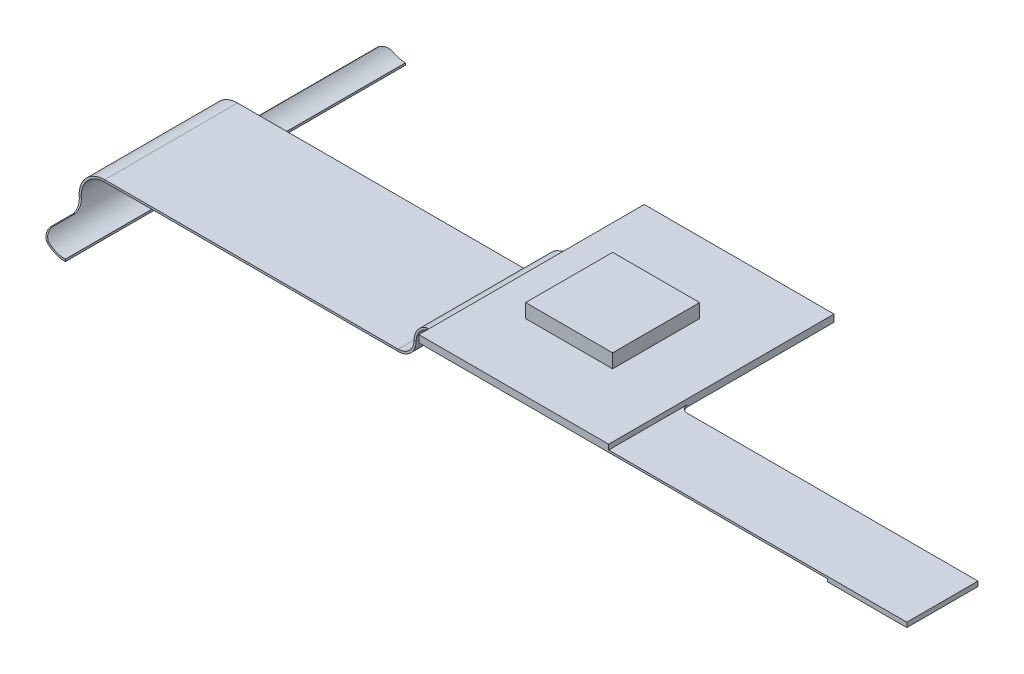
ISO-10303-21;
HEADER;
FILE_DESCRIPTION(('STEP AP214'),'2;1');
FILE_NAME('part.step','',(''),(''),'','','');
FILE_SCHEMA(('AUTOMOTIVE_DESIGN { 1 0 10303 214 1 1 1 1 }'));
ENDSEC;
DATA;
#1=APPLICATION_CONTEXT('core data for automotive mechanical design processes');
#2=APPLICATION_PROTOCOL_DEFINITION('international standard','automotive_design',2000,#1);
#3=PRODUCT_CONTEXT('',#1,'mechanical');
#4=PRODUCT('Part','Part','',(#3));
#5=PRODUCT_RELATED_PRODUCT_CATEGORY('part','',(#4));
#6=PRODUCT_DEFINITION_FORMATION('','',#4);
#7=PRODUCT_DEFINITION_CONTEXT('part definition',#1,'design');
#8=PRODUCT_DEFINITION('design','',#6,#7);
#9=PRODUCT_DEFINITION_SHAPE('','',#8);
#10=(LENGTH_UNIT() NAMED_UNIT(*) SI_UNIT(.MILLI.,.METRE.));
#11=(NAMED_UNIT(*) PLANE_ANGLE_UNIT() SI_UNIT($,.RADIAN.));
#12=(NAMED_UNIT(*) SI_UNIT($,.STERADIAN.) SOLID_ANGLE_UNIT());
#13=UNCERTAINTY_MEASURE_WITH_UNIT(LENGTH_MEASURE(1.E-05),#10,'distance_accuracy_value','');
#14=(GEOMETRIC_REPRESENTATION_CONTEXT(3) GLOBAL_UNCERTAINTY_ASSIGNED_CONTEXT((#13)) GLOBAL_UNIT_ASSIGNED_CONTEXT((#10,
#11,#12)) REPRESENTATION_CONTEXT('',''));
#15=CARTESIAN_POINT('',(0.,0.,0.));
#16=DIRECTION('',(0.,0.,1.));
#17=DIRECTION('',(1.,0.,0.));
#18=AXIS2_PLACEMENT_3D('',#15,#16,#17);
#19=CARTESIAN_POINT('',(-0.315796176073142,2.00000000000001,-21.));
#20=DIRECTION('',(0.,1.,0.));
#21=DIRECTION('',(0.,0.,1.));
#22=AXIS2_PLACEMENT_3D('',#19,#20,#21);
#23=PLANE('',#22);
#24=DIRECTION('',(0.,0.,-1.));
#25=VECTOR('',#24,1.);
#26=CARTESIAN_POINT('',(51.6,2.00000000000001,-1.50000000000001));
#27=LINE('',#26,#25);
#28=CARTESIAN_POINT('',(51.6,2.00000000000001,-1.50000000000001));
#29=VERTEX_POINT('',#28);
#30=CARTESIAN_POINT('',(51.6,2.00000000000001,-6.00000000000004));
#31=VERTEX_POINT('',#30);
#32=EDGE_CURVE('E367',#29,#31,#27,.T.);
#33=ORIENTED_EDGE('',*,*,#32,.F.);
#34=DIRECTION('',(1.,0.,0.));
#35=VECTOR('',#34,1.);
#36=CARTESIAN_POINT('',(56.6,2.00000000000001,-1.50000000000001));
#37=LINE('',#36,#35);
#38=CARTESIAN_POINT('',(25.75,2.00000000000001,-1.5));
#39=VERTEX_POINT('',#38);
#40=EDGE_CURVE('E353',#39,#29,#37,.T.);
#41=ORIENTED_EDGE('',*,*,#40,.F.);
#42=DIRECTION('',(0.,0.,1.));
#43=VECTOR('',#42,1.);
#44=CARTESIAN_POINT('',(25.75,2.00000000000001,-1.5));
#45=LINE('',#44,#43);
#46=CARTESIAN_POINT('',(25.75,2.00000000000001,-2.00000000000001));
#47=VERTEX_POINT('',#46);
#48=EDGE_CURVE('E618',#47,#39,#45,.T.);
#49=ORIENTED_EDGE('',*,*,#48,.F.);
#50=CARTESIAN_POINT('',(25.25,2.00000000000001,-2.));
#51=DIRECTION('',(0.,-1.,0.));
#52=DIRECTION('',(0.,0.,-1.));
#53=AXIS2_PLACEMENT_3D('',#50,#51,#52);
#54=CIRCLE('',#53,0.5);
#55=CARTESIAN_POINT('',(25.5782852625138,2.00000000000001,-2.37713231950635));
#56=VERTEX_POINT('',#55);
#57=EDGE_CURVE('E624',#56,#47,#54,.T.);
#58=ORIENTED_EDGE('',*,*,#57,.F.);
#59=DIRECTION('',(0.,0.,1.));
#60=VECTOR('',#59,1.);
#61=CARTESIAN_POINT('',(25.5782852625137,2.00000000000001,-21.));
#62=LINE('',#61,#60);
#63=CARTESIAN_POINT('',(25.5782852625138,2.00000000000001,-11.0228676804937));
#64=VERTEX_POINT('',#63);
#65=EDGE_CURVE('E541',#64,#56,#62,.T.);
#66=ORIENTED_EDGE('',*,*,#65,.F.);
#67=CARTESIAN_POINT('',(25.25,2.00000000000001,-11.4));
#68=DIRECTION('',(0.,-1.,0.));
#69=DIRECTION('',(0.,0.,-1.));
#70=AXIS2_PLACEMENT_3D('',#67,#68,#69);
#71=CIRCLE('',#70,0.5);
#72=CARTESIAN_POINT('',(25.75,2.00000000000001,-11.4));
#73=VERTEX_POINT('',#72);
#74=EDGE_CURVE('E584',#73,#64,#71,.T.);
#75=ORIENTED_EDGE('',*,*,#74,.F.);
#76=DIRECTION('',(0.,0.,1.));
#77=VECTOR('',#76,1.);
#78=CARTESIAN_POINT('',(25.75,2.00000000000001,-11.4));
#79=LINE('',#78,#77);
#80=CARTESIAN_POINT('',(25.75,2.,-15.75));
#81=VERTEX_POINT('',#80);
#82=EDGE_CURVE('E592',#81,#73,#79,.T.);
#83=ORIENTED_EDGE('',*,*,#82,.F.);
#84=DIRECTION('',(-1.,0.,0.));
#85=VECTOR('',#84,1.);
#86=CARTESIAN_POINT('',(25.75,2.,-15.75));
#87=LINE('',#86,#85);
#88=CARTESIAN_POINT('',(37.75,2.,-15.7500000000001));
#89=VERTEX_POINT('',#88);
#90=EDGE_CURVE('E597',#89,#81,#87,.T.);
#91=ORIENTED_EDGE('',*,*,#90,.F.);
#92=DIRECTION('',(0.,0.,-1.));
#93=VECTOR('',#92,1.);
#94=CARTESIAN_POINT('',(37.75,2.,-15.7500000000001));
#95=LINE('',#94,#93);
#96=CARTESIAN_POINT('',(37.75,2.,-6.50000000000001));
#97=VERTEX_POINT('',#96);
#98=EDGE_CURVE('E602',#97,#89,#95,.T.);
#99=ORIENTED_EDGE('',*,*,#98,.F.);
#100=CARTESIAN_POINT('',(38.25,2.,-6.50000000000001));
#101=DIRECTION('',(0.,-1.,0.));
#102=DIRECTION('',(0.,0.,-1.));
#103=AXIS2_PLACEMENT_3D('',#100,#101,#102);
#104=CIRCLE('',#103,0.5);
#105=CARTESIAN_POINT('',(38.25,2.,-6.00000000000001));
#106=VERTEX_POINT('',#105);
#107=EDGE_CURVE('E607',#106,#97,#104,.T.);
#108=ORIENTED_EDGE('',*,*,#107,.F.);
#109=DIRECTION('',(-1.,0.,0.));
#110=VECTOR('',#109,1.);
#111=CARTESIAN_POINT('',(38.25,2.,-6.00000000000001));
#112=LINE('',#111,#110);
#113=EDGE_CURVE('E612',#31,#106,#112,.T.);
#114=ORIENTED_EDGE('',*,*,#113,.F.);
#115=EDGE_LOOP('',(#33,#41,#49,#58,#66,#75,#83,#91,#99,#108,#114));
#116=FACE_BOUND('',#115,.T.);
#117=ADVANCED_FACE('F98',(#116),#23,.F.);
#118=CARTESIAN_POINT('',(0.,2.45000000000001,0.));
#119=DIRECTION('',(0.,-1.,0.));
#120=DIRECTION('',(0.,0.,-1.));
#121=AXIS2_PLACEMENT_3D('',#118,#119,#120);
#122=PLANE('',#121);
#123=DIRECTION('',(0.,0.,-1.));
#124=VECTOR('',#123,1.);
#125=CARTESIAN_POINT('',(37.75,2.45,-15.7500000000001));
#126=LINE('',#125,#124);
#127=CARTESIAN_POINT('',(37.75,2.45000000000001,-1.50000000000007));
#128=VERTEX_POINT('',#127);
#129=CARTESIAN_POINT('',(37.75,2.45,-15.7500000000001));
#130=VERTEX_POINT('',#129);
#131=EDGE_CURVE('E406',#128,#130,#126,.T.);
#132=ORIENTED_EDGE('',*,*,#131,.T.);
#133=DIRECTION('',(-1.,0.,0.));
#134=VECTOR('',#133,1.);
#135=CARTESIAN_POINT('',(37.75,2.45,-15.7500000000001));
#136=LINE('',#135,#134);
#137=CARTESIAN_POINT('',(25.75,2.45,-15.75));
#138=VERTEX_POINT('',#137);
#139=EDGE_CURVE('E409',#130,#138,#136,.T.);
#140=ORIENTED_EDGE('',*,*,#139,.T.);
#141=DIRECTION('',(0.,0.,1.));
#142=VECTOR('',#141,1.);
#143=CARTESIAN_POINT('',(25.75,2.45,-15.75));
#144=LINE('',#143,#142);
#145=CARTESIAN_POINT('',(25.75,2.45000000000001,-1.5));
#146=VERTEX_POINT('',#145);
#147=EDGE_CURVE('E412',#138,#146,#144,.T.);
#148=ORIENTED_EDGE('',*,*,#147,.T.);
#149=DIRECTION('',(1.,0.,0.));
#150=VECTOR('',#149,1.);
#151=CARTESIAN_POINT('',(37.75,2.45000000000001,-1.50000000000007));
#152=LINE('',#151,#150);
#153=EDGE_CURVE('E415',#146,#128,#152,.T.);
#154=ORIENTED_EDGE('',*,*,#153,.T.);
#155=EDGE_LOOP('',(#132,#140,#148,#154));
#156=FACE_BOUND('',#155,.T.);
#157=DIRECTION('',(0.,0.,1.));
#158=VECTOR('',#157,1.);
#159=CARTESIAN_POINT('',(28.25,2.45000000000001,-5.75000000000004));
#160=LINE('',#159,#158);
#161=CARTESIAN_POINT('',(28.25,2.45000000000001,-11.25));
#162=VERTEX_POINT('',#161);
#163=CARTESIAN_POINT('',(28.25,2.45000000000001,-5.75000000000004));
#164=VERTEX_POINT('',#163);
#165=EDGE_CURVE('E375',#162,#164,#160,.T.);
#166=ORIENTED_EDGE('',*,*,#165,.F.);
#167=DIRECTION('',(-1.,0.,0.));
#168=VECTOR('',#167,1.);
#169=CARTESIAN_POINT('',(28.25,2.45000000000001,-11.25));
#170=LINE('',#169,#168);
#171=CARTESIAN_POINT('',(33.75,2.45000000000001,-11.25));
#172=VERTEX_POINT('',#171);
#173=EDGE_CURVE('E380',#172,#162,#170,.T.);
#174=ORIENTED_EDGE('',*,*,#173,.F.);
#175=DIRECTION('',(0.,0.,-1.));
#176=VECTOR('',#175,1.);
#177=CARTESIAN_POINT('',(33.75,2.45,-5.75000000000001));
#178=LINE('',#177,#176);
#179=CARTESIAN_POINT('',(33.75,2.45,-5.75000000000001));
#180=VERTEX_POINT('',#179);
#181=EDGE_CURVE('E390',#180,#172,#178,.T.);
#182=ORIENTED_EDGE('',*,*,#181,.F.);
#183=DIRECTION('',(1.,0.,0.));
#184=VECTOR('',#183,1.);
#185=CARTESIAN_POINT('',(28.25,2.45000000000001,-5.75000000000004));
#186=LINE('',#185,#184);
#187=EDGE_CURVE('E121',#164,#180,#186,.T.);
#188=ORIENTED_EDGE('',*,*,#187,.F.);
#189=EDGE_LOOP('',(#166,#174,#182,#188));
#190=FACE_BOUND('',#189,.T.);
#191=ADVANCED_FACE('F446',(#156,#190),#122,.F.);
#192=CARTESIAN_POINT('',(-0.315796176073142,2.13000000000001,-21.));
#193=DIRECTION('',(0.,1.,0.));
#194=DIRECTION('',(0.,0.,1.));
#195=AXIS2_PLACEMENT_3D('',#192,#193,#194);
#196=PLANE('',#195);
#197=CARTESIAN_POINT('',(38.25,2.13,-6.50000000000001));
#198=DIRECTION('',(0.,-1.,0.));
#199=DIRECTION('',(0.,0.,-1.));
#200=AXIS2_PLACEMENT_3D('',#197,#198,#199);
#201=CIRCLE('',#200,0.5);
#202=CARTESIAN_POINT('',(38.25,2.13,-6.00000000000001));
#203=VERTEX_POINT('',#202);
#204=CARTESIAN_POINT('',(37.75,2.13,-6.50000000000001));
#205=VERTEX_POINT('',#204);
#206=EDGE_CURVE('E560',#203,#205,#201,.T.);
#207=ORIENTED_EDGE('',*,*,#206,.T.);
#208=DIRECTION('',(0.,0.,-1.));
#209=VECTOR('',#208,1.);
#210=CARTESIAN_POINT('',(37.75,2.13,-15.7500000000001));
#211=LINE('',#210,#209);
#212=CARTESIAN_POINT('',(37.75,2.13000000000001,-1.50000000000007));
#213=VERTEX_POINT('',#212);
#214=EDGE_CURVE('E405',#213,#205,#211,.T.);
#215=ORIENTED_EDGE('',*,*,#214,.F.);
#216=DIRECTION('',(1.,0.,0.));
#217=VECTOR('',#216,1.);
#218=CARTESIAN_POINT('',(56.6,2.13000000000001,-1.50000000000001));
#219=LINE('',#218,#217);
#220=CARTESIAN_POINT('',(56.6,2.13000000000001,-1.50000000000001));
#221=VERTEX_POINT('',#220);
#222=EDGE_CURVE('E568',#213,#221,#219,.T.);
#223=ORIENTED_EDGE('',*,*,#222,.T.);
#224=DIRECTION('',(0.,0.,-1.));
#225=VECTOR('',#224,1.);
#226=CARTESIAN_POINT('',(56.6,2.13000000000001,-6.00000000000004));
#227=LINE('',#226,#225);
#228=CARTESIAN_POINT('',(56.6,2.13000000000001,-6.00000000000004));
#229=VERTEX_POINT('',#228);
#230=EDGE_CURVE('E350',#221,#229,#227,.T.);
#231=ORIENTED_EDGE('',*,*,#230,.T.);
#232=DIRECTION('',(-1.,0.,0.));
#233=VECTOR('',#232,1.);
#234=CARTESIAN_POINT('',(38.25,2.13,-6.00000000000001));
#235=LINE('',#234,#233);
#236=EDGE_CURVE('E564',#229,#203,#235,.T.);
#237=ORIENTED_EDGE('',*,*,#236,.T.);
#238=EDGE_LOOP('',(#207,#215,#223,#231,#237));
#239=FACE_BOUND('',#238,.T.);
#240=ADVANCED_FACE('F476',(#239),#196,.T.);
#241=CARTESIAN_POINT('',(25.25,2.13000000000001,-2.));
#242=DIRECTION('',(0.,-1.,0.));
#243=DIRECTION('',(0.,0.,-1.));
#244=AXIS2_PLACEMENT_3D('',#241,#242,#243);
#245=CIRCLE('',#244,0.5);
#246=CARTESIAN_POINT('',(25.5782852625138,2.13000000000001,-2.37713231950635));
#247=VERTEX_POINT('',#246);
#248=CARTESIAN_POINT('',(25.75,2.13000000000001,-2.00000000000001));
#249=VERTEX_POINT('',#248);
#250=EDGE_CURVE('E570',#247,#249,#245,.T.);
#251=ORIENTED_EDGE('',*,*,#250,.T.);
#252=DIRECTION('',(0.,0.,-1.));
#253=VECTOR('',#252,1.);
#254=CARTESIAN_POINT('',(25.7499999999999,2.13000000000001,-21.));
#255=LINE('',#254,#253);
#256=CARTESIAN_POINT('',(25.75,2.13000000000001,-11.4));
#257=VERTEX_POINT('',#256);
#258=EDGE_CURVE('E14',#249,#257,#255,.T.);
#259=ORIENTED_EDGE('',*,*,#258,.T.);
#260=CARTESIAN_POINT('',(25.25,2.13000000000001,-11.4));
#261=DIRECTION('',(0.,-1.,0.));
#262=DIRECTION('',(0.,0.,-1.));
#263=AXIS2_PLACEMENT_3D('',#260,#261,#262);
#264=CIRCLE('',#263,0.5);
#265=CARTESIAN_POINT('',(25.5782852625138,2.13000000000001,-11.0228676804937));
#266=VERTEX_POINT('',#265);
#267=EDGE_CURVE('E577',#257,#266,#264,.T.);
#268=ORIENTED_EDGE('',*,*,#267,.T.);
#269=DIRECTION('',(0.,0.,1.));
#270=VECTOR('',#269,1.);
#271=CARTESIAN_POINT('',(25.5782852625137,2.13000000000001,-21.));
#272=LINE('',#271,#270);
#273=EDGE_CURVE('E572',#266,#247,#272,.T.);
#274=ORIENTED_EDGE('',*,*,#273,.T.);
#275=EDGE_LOOP('',(#251,#259,#268,#274));
#276=FACE_BOUND('',#275,.T.);
#277=ADVANCED_FACE('F1294',(#276),#196,.T.);
#278=CARTESIAN_POINT('',(0.899999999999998,-0.130000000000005,-21.));
#279=DIRECTION('',(0.,1.,0.));
#280=DIRECTION('',(0.,0.,1.));
#281=AXIS2_PLACEMENT_3D('',#278,#279,#280);
#282=PLANE('',#281);
#283=DIRECTION('',(-1.,0.,0.));
#284=VECTOR('',#283,1.);
#285=CARTESIAN_POINT('',(1.90000000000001,-0.13,-10.9));
#286=LINE('',#285,#284);
#287=CARTESIAN_POINT('',(23.4482852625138,-0.13,-10.9));
#288=VERTEX_POINT('',#287);
#289=CARTESIAN_POINT('',(4.8847343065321,-0.130000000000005,-10.9));
#290=VERTEX_POINT('',#289);
#291=EDGE_CURVE('E692',#288,#290,#286,.T.);
#292=ORIENTED_EDGE('',*,*,#291,.F.);
#293=DIRECTION('',(0.,0.,1.));
#294=VECTOR('',#293,1.);
#295=CARTESIAN_POINT('',(23.4482852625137,-0.130000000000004,-21.));
#296=LINE('',#295,#294);
#297=CARTESIAN_POINT('',(23.4482852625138,-0.130000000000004,-2.5));
#298=VERTEX_POINT('',#297);
#299=EDGE_CURVE('E685',#288,#298,#296,.T.);
#300=ORIENTED_EDGE('',*,*,#299,.T.);
#301=DIRECTION('',(1.,0.,0.));
#302=VECTOR('',#301,1.);
#303=CARTESIAN_POINT('',(25.25,-0.13,-2.5));
#304=LINE('',#303,#302);
#305=CARTESIAN_POINT('',(4.88473430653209,-0.130000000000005,-2.50000000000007));
#306=VERTEX_POINT('',#305);
#307=EDGE_CURVE('E1079',#306,#298,#304,.T.);
#308=ORIENTED_EDGE('',*,*,#307,.F.);
#309=DIRECTION('',(0.,0.,-1.));
#310=VECTOR('',#309,1.);
#311=CARTESIAN_POINT('',(4.88473430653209,-0.130000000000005,-21.0000000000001));
#312=LINE('',#311,#310);
#313=EDGE_CURVE('E671',#306,#290,#312,.T.);
#314=ORIENTED_EDGE('',*,*,#313,.T.);
#315=EDGE_LOOP('',(#292,#300,#308,#314));
#316=FACE_BOUND('',#315,.T.);
#317=ADVANCED_FACE('F953',(#316),#282,.F.);
#318=CARTESIAN_POINT('',(4.90000000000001,-3.1,0.));
#319=DIRECTION('',(0.,0.,1.));
#320=DIRECTION('',(-1.,0.,0.));
#321=AXIS2_PLACEMENT_3D('',#318,#319,#320);
#322=PLANE('',#321);
#323=DIRECTION('',(-1.,0.,0.));
#324=VECTOR('',#323,1.);
#325=CARTESIAN_POINT('',(4.90000000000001,-3.1,0.));
#326=LINE('',#325,#324);
#327=CARTESIAN_POINT('',(4.90000000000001,-3.1,0.));
#328=VERTEX_POINT('',#327);
#329=CARTESIAN_POINT('',(4.8847343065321,-3.1,0.));
#330=VERTEX_POINT('',#329);
#331=EDGE_CURVE('E637',#328,#330,#326,.T.);
#332=ORIENTED_EDGE('',*,*,#331,.T.);
#333=DIRECTION('',(0.,-1.,0.));
#334=VECTOR('',#333,1.);
#335=CARTESIAN_POINT('',(4.8847343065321,-3.1,0.));
#336=LINE('',#335,#334);
#337=CARTESIAN_POINT('',(4.88473430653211,-3.23,0.));
#338=VERTEX_POINT('',#337);
#339=EDGE_CURVE('E656',#330,#338,#336,.T.);
#340=ORIENTED_EDGE('',*,*,#339,.T.);
#341=DIRECTION('',(-1.,0.,0.));
#342=VECTOR('',#341,1.);
#343=CARTESIAN_POINT('',(4.90000000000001,-3.23,0.));
#344=LINE('',#343,#342);
#345=CARTESIAN_POINT('',(4.90000000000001,-3.23,0.));
#346=VERTEX_POINT('',#345);
#347=EDGE_CURVE('E648',#346,#338,#344,.T.);
#348=ORIENTED_EDGE('',*,*,#347,.F.);
#349=DIRECTION('',(0.,-1.,0.));
#350=VECTOR('',#349,1.);
#351=CARTESIAN_POINT('',(4.90000000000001,-3.1,0.));
#352=LINE('',#351,#350);
#353=EDGE_CURVE('E669',#328,#346,#352,.T.);
#354=ORIENTED_EDGE('',*,*,#353,.F.);
#355=EDGE_LOOP('',(#332,#340,#348,#354));
#356=FACE_BOUND('',#355,.T.);
#357=ADVANCED_FACE('F1300',(#356),#322,.T.);
#358=CARTESIAN_POINT('',(4.90000000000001,-3.1,-21.5000000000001));
#359=DIRECTION('',(0.,0.,-1.));
#360=DIRECTION('',(1.,0.,0.));
#361=AXIS2_PLACEMENT_3D('',#358,#359,#360);
#362=PLANE('',#361);
#363=DIRECTION('',(1.,0.,0.));
#364=VECTOR('',#363,1.);
#365=CARTESIAN_POINT('',(4.90000000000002,-3.23,-21.5000000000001));
#366=LINE('',#365,#364);
#367=CARTESIAN_POINT('',(4.88473430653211,-3.23,-21.5000000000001));
#368=VERTEX_POINT('',#367);
#369=CARTESIAN_POINT('',(4.90000000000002,-3.23,-21.5000000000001));
#370=VERTEX_POINT('',#369);
#371=EDGE_CURVE('E651',#368,#370,#366,.T.);
#372=ORIENTED_EDGE('',*,*,#371,.F.);
#373=DIRECTION('',(0.,1.,0.));
#374=VECTOR('',#373,1.);
#375=CARTESIAN_POINT('',(4.88473430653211,-3.1,-21.5000000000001));
#376=LINE('',#375,#374);
#377=CARTESIAN_POINT('',(4.88473430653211,-3.1,-21.5000000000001));
#378=VERTEX_POINT('',#377);
#379=EDGE_CURVE('E647',#368,#378,#376,.T.);
#380=ORIENTED_EDGE('',*,*,#379,.T.);
#381=DIRECTION('',(1.,0.,0.));
#382=VECTOR('',#381,1.);
#383=CARTESIAN_POINT('',(4.90000000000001,-3.1,-21.5000000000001));
#384=LINE('',#383,#382);
#385=CARTESIAN_POINT('',(4.90000000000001,-3.1,-21.5000000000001));
#386=VERTEX_POINT('',#385);
#387=EDGE_CURVE('E644',#378,#386,#384,.T.);
#388=ORIENTED_EDGE('',*,*,#387,.T.);
#389=DIRECTION('',(0.,-1.,0.));
#390=VECTOR('',#389,1.);
#391=CARTESIAN_POINT('',(4.90000000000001,-3.1,-21.5000000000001));
#392=LINE('',#391,#390);
#393=EDGE_CURVE('E646',#386,#370,#392,.T.);
#394=ORIENTED_EDGE('',*,*,#393,.T.);
#395=EDGE_LOOP('',(#372,#380,#388,#394));
#396=FACE_BOUND('',#395,.T.);
#397=ADVANCED_FACE('F1578',(#396),#362,.T.);
#398=CARTESIAN_POINT('',(4.00000000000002,-3.23000000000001,-21.));
#399=DIRECTION('',(0.,-1.,0.));
#400=DIRECTION('',(0.,0.,1.));
#401=AXIS2_PLACEMENT_3D('',#398,#399,#400);
#402=PLANE('',#401);
#403=ORIENTED_EDGE('',*,*,#347,.T.);
#404=DIRECTION('',(0.,0.,-1.));
#405=VECTOR('',#404,1.);
#406=CARTESIAN_POINT('',(4.88473430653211,-3.23,-21.0000000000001));
#407=LINE('',#406,#405);
#408=EDGE_CURVE('E650',#338,#368,#407,.T.);
#409=ORIENTED_EDGE('',*,*,#408,.T.);
#410=ORIENTED_EDGE('',*,*,#371,.T.);
#411=DIRECTION('',(0.,0.,1.));
#412=VECTOR('',#411,1.);
#413=CARTESIAN_POINT('',(4.90000000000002,-3.23,-21.5000000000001));
#414=LINE('',#413,#412);
#415=EDGE_CURVE('E653',#370,#346,#414,.T.);
#416=ORIENTED_EDGE('',*,*,#415,.T.);
#417=EDGE_LOOP('',(#403,#409,#410,#416));
#418=FACE_BOUND('',#417,.T.);
#419=ADVANCED_FACE('F1571',(#418),#402,.T.);
#420=CARTESIAN_POINT('',(4.90000000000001,-3.1,-21.5000000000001));
#421=DIRECTION('',(1.,0.,0.));
#422=DIRECTION('',(0.,0.,1.));
#423=AXIS2_PLACEMENT_3D('',#420,#421,#422);
#424=PLANE('',#423);
#425=ORIENTED_EDGE('',*,*,#415,.F.);
#426=ORIENTED_EDGE('',*,*,#393,.F.);
#427=DIRECTION('',(0.,0.,1.));
#428=VECTOR('',#427,1.);
#429=CARTESIAN_POINT('',(4.90000000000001,-3.1,-21.5000000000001));
#430=LINE('',#429,#428);
#431=EDGE_CURVE('E672',#386,#328,#430,.T.);
#432=ORIENTED_EDGE('',*,*,#431,.T.);
#433=ORIENTED_EDGE('',*,*,#353,.T.);
#434=EDGE_LOOP('',(#425,#426,#432,#433));
#435=FACE_BOUND('',#434,.T.);
#436=ADVANCED_FACE('F713',(#435),#424,.T.);
#437=CARTESIAN_POINT('',(4.00000000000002,-3.10000000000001,-21.));
#438=DIRECTION('',(0.,-1.,0.));
#439=DIRECTION('',(0.,0.,1.));
#440=AXIS2_PLACEMENT_3D('',#437,#438,#439);
#441=PLANE('',#440);
#442=DIRECTION('',(0.,0.,-1.));
#443=VECTOR('',#442,1.);
#444=CARTESIAN_POINT('',(4.88473430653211,-3.1,-21.0000000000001));
#445=LINE('',#444,#443);
#446=EDGE_CURVE('E662',#330,#378,#445,.T.);
#447=ORIENTED_EDGE('',*,*,#446,.F.);
#448=ORIENTED_EDGE('',*,*,#331,.F.);
#449=ORIENTED_EDGE('',*,*,#431,.F.);
#450=ORIENTED_EDGE('',*,*,#387,.F.);
#451=EDGE_LOOP('',(#447,#448,#449,#450));
#452=FACE_BOUND('',#451,.T.);
#453=ADVANCED_FACE('F1559',(#452),#441,.F.);
#454=CARTESIAN_POINT('',(1.90000000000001,-0.13,-10.9));
#455=DIRECTION('',(0.,0.,-1.));
#456=DIRECTION('',(-1.,0.,0.));
#457=AXIS2_PLACEMENT_3D('',#454,#455,#456);
#458=PLANE('',#457);
#459=DIRECTION('',(0.,1.,0.));
#460=VECTOR('',#459,1.);
#461=CARTESIAN_POINT('',(23.4482852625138,-0.13,-10.9));
#462=LINE('',#461,#460);
#463=CARTESIAN_POINT('',(23.4482852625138,0.,-10.9));
#464=VERTEX_POINT('',#463);
#465=EDGE_CURVE('E1111',#288,#464,#462,.T.);
#466=ORIENTED_EDGE('',*,*,#465,.F.);
#467=ORIENTED_EDGE('',*,*,#291,.T.);
#468=DIRECTION('',(0.,-1.,0.));
#469=VECTOR('',#468,1.);
#470=CARTESIAN_POINT('',(4.8847343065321,-0.130000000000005,-10.9));
#471=LINE('',#470,#469);
#472=CARTESIAN_POINT('',(4.8847343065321,0.,-10.9));
#473=VERTEX_POINT('',#472);
#474=EDGE_CURVE('E681',#473,#290,#471,.T.);
#475=ORIENTED_EDGE('',*,*,#474,.F.);
#476=DIRECTION('',(-1.,0.,0.));
#477=VECTOR('',#476,1.);
#478=CARTESIAN_POINT('',(1.90000000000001,0.,-10.9));
#479=LINE('',#478,#477);
#480=EDGE_CURVE('E1120',#464,#473,#479,.T.);
#481=ORIENTED_EDGE('',*,*,#480,.F.);
#482=EDGE_LOOP('',(#466,#467,#475,#481));
#483=FACE_BOUND('',#482,.T.);
#484=ADVANCED_FACE('F100',(#483),#458,.T.);
#485=CARTESIAN_POINT('',(0.899999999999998,0.,-21.));
#486=DIRECTION('',(0.,1.,0.));
#487=DIRECTION('',(0.,0.,1.));
#488=AXIS2_PLACEMENT_3D('',#485,#486,#487);
#489=PLANE('',#488);
#490=DIRECTION('',(0.,0.,1.));
#491=VECTOR('',#490,1.);
#492=CARTESIAN_POINT('',(23.4482852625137,0.,-21.));
#493=LINE('',#492,#491);
#494=CARTESIAN_POINT('',(23.4482852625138,0.,-2.5));
#495=VERTEX_POINT('',#494);
#496=EDGE_CURVE('E1114',#464,#495,#493,.T.);
#497=ORIENTED_EDGE('',*,*,#496,.F.);
#498=ORIENTED_EDGE('',*,*,#480,.T.);
#499=DIRECTION('',(0.,0.,-1.));
#500=VECTOR('',#499,1.);
#501=CARTESIAN_POINT('',(4.88473430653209,0.,-21.0000000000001));
#502=LINE('',#501,#500);
#503=CARTESIAN_POINT('',(4.88473430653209,0.,-2.50000000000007));
#504=VERTEX_POINT('',#503);
#505=EDGE_CURVE('E682',#504,#473,#502,.T.);
#506=ORIENTED_EDGE('',*,*,#505,.F.);
#507=DIRECTION('',(1.,0.,0.));
#508=VECTOR('',#507,1.);
#509=CARTESIAN_POINT('',(25.25,0.,-2.5));
#510=LINE('',#509,#508);
#511=EDGE_CURVE('E1083',#504,#495,#510,.T.);
#512=ORIENTED_EDGE('',*,*,#511,.T.);
#513=EDGE_LOOP('',(#497,#498,#506,#512));
#514=FACE_BOUND('',#513,.T.);
#515=ADVANCED_FACE('F1123',(#514),#489,.T.);
#516=CARTESIAN_POINT('',(25.25,-0.13,-2.5));
#517=DIRECTION('',(0.,0.,1.));
#518=DIRECTION('',(1.,0.,0.));
#519=AXIS2_PLACEMENT_3D('',#516,#517,#518);
#520=PLANE('',#519);
#521=DIRECTION('',(0.,-1.,0.));
#522=VECTOR('',#521,1.);
#523=CARTESIAN_POINT('',(23.4482852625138,-0.130000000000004,-2.5));
#524=LINE('',#523,#522);
#525=EDGE_CURVE('E106',#495,#298,#524,.T.);
#526=ORIENTED_EDGE('',*,*,#525,.F.);
#527=ORIENTED_EDGE('',*,*,#511,.F.);
#528=DIRECTION('',(0.,1.,0.));
#529=VECTOR('',#528,1.);
#530=CARTESIAN_POINT('',(4.88473430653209,-0.130000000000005,-2.50000000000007));
#531=LINE('',#530,#529);
#532=EDGE_CURVE('E677',#306,#504,#531,.T.);
#533=ORIENTED_EDGE('',*,*,#532,.F.);
#534=ORIENTED_EDGE('',*,*,#307,.T.);
#535=EDGE_LOOP('',(#526,#527,#533,#534));
#536=FACE_BOUND('',#535,.T.);
#537=ADVANCED_FACE('F1130',(#536),#520,.T.);
#538=CARTESIAN_POINT('',(4.88473430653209,-1.615,0.));
#539=DIRECTION('',(0.,0.,-1.));
#540=DIRECTION('',(-1.,0.,0.));
#541=AXIS2_PLACEMENT_3D('',#538,#539,#540);
#542=PLANE('',#541);
#543=CARTESIAN_POINT('',(3.73003338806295,-2.74411061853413,0.));
#544=CARTESIAN_POINT('',(3.82298144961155,-2.6532224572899,0.));
#545=B_SPLINE_CURVE_WITH_KNOTS('',1,(#543,#544),.UNSPECIFIED.,.F.,.F.,(2,2),(0.,1.),.UNSPECIFIED.);
#546=CARTESIAN_POINT('',(3.73003338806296,-2.74411061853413,0.));
#547=VERTEX_POINT('',#546);
#548=CARTESIAN_POINT('',(3.82298144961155,-2.6532224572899,0.));
#549=VERTEX_POINT('',#548);
#550=EDGE_CURVE('E749',#547,#549,#545,.T.);
#551=ORIENTED_EDGE('',*,*,#550,.F.);
#552=CARTESIAN_POINT('',(4.88473430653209,-1.615,0.));
#553=DIRECTION('',(0.,0.,-1.));
#554=DIRECTION('',(-1.,0.,0.));
#555=AXIS2_PLACEMENT_3D('',#552,#553,#554);
#556=CIRCLE('',#555,1.615);
#557=EDGE_CURVE('E1074',#547,#338,#556,.F.);
#558=ORIENTED_EDGE('',*,*,#557,.T.);
#559=ORIENTED_EDGE('',*,*,#339,.F.);
#560=CARTESIAN_POINT('',(4.88473430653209,-1.615,0.));
#561=DIRECTION('',(0.,0.,1.));
#562=DIRECTION('',(-1.,0.,0.));
#563=AXIS2_PLACEMENT_3D('',#560,#561,#562);
#564=CIRCLE('',#563,1.485);
#565=EDGE_CURVE('E666',#549,#330,#564,.T.);
#566=ORIENTED_EDGE('',*,*,#565,.F.);
#567=EDGE_LOOP('',(#551,#558,#559,#566));
#568=FACE_BOUND('',#567,.T.);
#569=ADVANCED_FACE('F715',(#568),#542,.F.);
#570=CARTESIAN_POINT('',(4.88473430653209,-1.61500000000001,-21.5000000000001));
#571=DIRECTION('',(0.,0.,1.));
#572=DIRECTION('',(1.,0.,0.));
#573=AXIS2_PLACEMENT_3D('',#570,#571,#572);
#574=PLANE('',#573);
#575=ORIENTED_EDGE('',*,*,#379,.F.);
#576=CARTESIAN_POINT('',(4.88473430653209,-1.61500000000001,-21.5000000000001));
#577=DIRECTION('',(0.,0.,-1.));
#578=DIRECTION('',(-1.,0.,0.));
#579=AXIS2_PLACEMENT_3D('',#576,#577,#578);
#580=CIRCLE('',#579,1.615);
#581=CARTESIAN_POINT('',(4.01214608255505,-2.97397564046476,-21.5));
#582=VERTEX_POINT('',#581);
#583=EDGE_CURVE('E1066',#368,#582,#580,.T.);
#584=ORIENTED_EDGE('',*,*,#583,.T.);
#585=CARTESIAN_POINT('',(4.08238538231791,-2.86458441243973,-21.5));
#586=CARTESIAN_POINT('',(4.01214608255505,-2.97397564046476,-21.5));
#587=B_SPLINE_CURVE_WITH_KNOTS('',1,(#585,#586),.UNSPECIFIED.,.F.,.F.,(2,2),(0.,1.),.UNSPECIFIED.);
#588=CARTESIAN_POINT('',(4.08238538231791,-2.86458441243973,-21.5));
#589=VERTEX_POINT('',#588);
#590=EDGE_CURVE('E1073',#582,#589,#587,.F.);
#591=ORIENTED_EDGE('',*,*,#590,.T.);
#592=CARTESIAN_POINT('',(4.88473430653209,-1.61500000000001,-21.5000000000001));
#593=DIRECTION('',(0.,0.,-1.));
#594=DIRECTION('',(1.,0.,0.));
#595=AXIS2_PLACEMENT_3D('',#592,#593,#594);
#596=CIRCLE('',#595,1.485);
#597=EDGE_CURVE('E665',#378,#589,#596,.T.);
#598=ORIENTED_EDGE('',*,*,#597,.F.);
#599=EDGE_LOOP('',(#575,#584,#591,#598));
#600=FACE_BOUND('',#599,.T.);
#601=ADVANCED_FACE('F768',(#600),#574,.F.);
#602=CARTESIAN_POINT('',(4.01214608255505,-2.97397564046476,-21.5));
#603=CARTESIAN_POINT('',(3.89905079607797,-2.90135799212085,-21.4737807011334));
#604=CARTESIAN_POINT('',(3.81536343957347,-2.82834662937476,-21.4190521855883));
#605=CARTESIAN_POINT('',(3.6914363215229,-2.70669776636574,-21.2523855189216));
#606=CARTESIAN_POINT('',(3.65104087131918,-2.65796636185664,-21.1404608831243));
#607=CARTESIAN_POINT('',(3.62633790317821,-2.62725663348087,-21.));
#608=CARTESIAN_POINT('',(4.08238538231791,-2.86458441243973,-21.5));
#609=CARTESIAN_POINT('',(3.97839458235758,-2.7978126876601,-21.4737809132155));
#610=CARTESIAN_POINT('',(3.90144282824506,-2.73067786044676,-21.4190521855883));
#611=CARTESIAN_POINT('',(3.78749126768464,-2.61882116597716,-21.2523855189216));
#612=CARTESIAN_POINT('',(3.75034789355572,-2.57401294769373,-21.1404635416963));
#613=CARTESIAN_POINT('',(3.72763296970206,-2.54577467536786,-21.));
#614=B_SPLINE_SURFACE_WITH_KNOTS('',1,3,((#602,#603,#604,#605,#606,#607),(#608,#609,#610,#611,
#612,#613)),.UNSPECIFIED.,.F.,.F.,.F.,(2,2),(4,2,4),(0.,1.),(0.,0.5,1.),.UNSPECIFIED.);
#615=CARTESIAN_POINT('',(4.01214608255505,-2.97397564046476,-21.5));
#616=CARTESIAN_POINT('',(3.89905079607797,-2.90135799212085,-21.4737807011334));
#617=CARTESIAN_POINT('',(3.81536343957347,-2.82834662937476,-21.4190521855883));
#618=CARTESIAN_POINT('',(3.6914363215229,-2.70669776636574,-21.2523855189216));
#619=CARTESIAN_POINT('',(3.65104087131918,-2.65796636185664,-21.1404608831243));
#620=CARTESIAN_POINT('',(3.62633790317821,-2.62725663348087,-21.));
#621=B_SPLINE_CURVE_WITH_KNOTS('',3,(#615,#616,#617,#618,#619,#620),.UNSPECIFIED.,.F.,.F.,(4,2,
4),(0.,0.5,1.),.UNSPECIFIED.);
#622=CARTESIAN_POINT('',(3.62633790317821,-2.62725663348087,-21.));
#623=VERTEX_POINT('',#622);
#624=EDGE_CURVE('E1061',#582,#623,#621,.T.);
#625=CARTESIAN_POINT('',(3.62633790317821,-2.62725663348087,-21.));
#626=CARTESIAN_POINT('',(3.72763296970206,-2.54577467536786,-21.));
#627=B_SPLINE_CURVE_WITH_KNOTS('',1,(#625,#626),.UNSPECIFIED.,.F.,.F.,(2,2),(0.,1.),.UNSPECIFIED.);
#628=CARTESIAN_POINT('',(3.72763296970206,-2.54577467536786,-21.));
#629=VERTEX_POINT('',#628);
#630=EDGE_CURVE('E804',#623,#629,#627,.T.);
#631=CARTESIAN_POINT('',(3.72763296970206,-2.54577467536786,-21.));
#632=CARTESIAN_POINT('',(3.75034789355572,-2.57401294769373,-21.1404635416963));
#633=CARTESIAN_POINT('',(3.78749126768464,-2.61882116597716,-21.2523855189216));
#634=CARTESIAN_POINT('',(3.90144282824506,-2.73067786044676,-21.4190521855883));
#635=CARTESIAN_POINT('',(3.97839458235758,-2.7978126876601,-21.4737809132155));
#636=CARTESIAN_POINT('',(4.08238538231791,-2.86458441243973,-21.5));
#637=B_SPLINE_CURVE_WITH_KNOTS('',3,(#631,#632,#633,#634,#635,#636),.UNSPECIFIED.,.F.,.F.,(4,2,
4),(0.,0.5,1.),.UNSPECIFIED.);
#638=EDGE_CURVE('E984',#589,#629,#637,.F.);
#639=ORIENTED_EDGE('',*,*,#590,.F.);
#640=ORIENTED_EDGE('',*,*,#624,.T.);
#641=ORIENTED_EDGE('',*,*,#630,.T.);
#642=ORIENTED_EDGE('',*,*,#638,.F.);
#643=EDGE_LOOP('',(#639,#640,#641,#642));
#644=FACE_BOUND('',#643,.T.);
#645=ADVANCED_FACE('F756',(#644),#614,.F.);
#646=CARTESIAN_POINT('',(3.72763296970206,-2.54577467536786,-16.2));
#647=DIRECTION('',(0.626784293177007,-0.779192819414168,0.));
#648=DIRECTION('',(0.,0.,1.));
#649=AXIS2_PLACEMENT_3D('',#646,#647,#648);
#650=PLANE('',#649);
#651=ORIENTED_EDGE('',*,*,#630,.F.);
#652=DIRECTION('',(0.,0.,-1.));
#653=VECTOR('',#652,1.);
#654=CARTESIAN_POINT('',(3.62633790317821,-2.62725663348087,15.3449228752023));
#655=LINE('',#654,#653);
#656=CARTESIAN_POINT('',(3.62633790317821,-2.62725663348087,-11.4));
#657=VERTEX_POINT('',#656);
#658=EDGE_CURVE('E997',#623,#657,#655,.F.);
#659=ORIENTED_EDGE('',*,*,#658,.T.);
#660=CARTESIAN_POINT('',(3.72763296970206,-2.54577467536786,-11.4));
#661=CARTESIAN_POINT('',(3.62633790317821,-2.62725663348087,-11.4));
#662=B_SPLINE_CURVE_WITH_KNOTS('',1,(#660,#661),.UNSPECIFIED.,.F.,.F.,(2,2),(0.,1.),.UNSPECIFIED.);
#663=CARTESIAN_POINT('',(3.72763296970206,-2.54577467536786,-11.4));
#664=VERTEX_POINT('',#663);
#665=EDGE_CURVE('E1004',#657,#664,#662,.F.);
#666=ORIENTED_EDGE('',*,*,#665,.T.);
#667=DIRECTION('',(0.,0.,1.));
#668=VECTOR('',#667,1.);
#669=CARTESIAN_POINT('',(3.72763296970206,-2.54577467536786,-11.4));
#670=LINE('',#669,#668);
#671=EDGE_CURVE('E981',#629,#664,#670,.T.);
#672=ORIENTED_EDGE('',*,*,#671,.F.);
#673=EDGE_LOOP('',(#651,#659,#666,#672));
#674=FACE_BOUND('',#673,.T.);
#675=ADVANCED_FACE('F767',(#674),#650,.F.);
#676=CARTESIAN_POINT('',(3.62633790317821,-2.62725663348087,-11.4));
#677=CARTESIAN_POINT('',(3.61064987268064,-2.60775391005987,-11.2740604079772));
#678=CARTESIAN_POINT('',(3.57525667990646,-2.56422728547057,-11.1694020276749));
#679=CARTESIAN_POINT('',(3.48103169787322,-2.41835738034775,-11.0027353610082));
#680=CARTESIAN_POINT('',(3.42206121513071,-2.31569174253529,-10.9407746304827));
#681=CARTESIAN_POINT('',(3.37034470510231,-2.1761141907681,-10.9));
#682=CARTESIAN_POINT('',(3.72763296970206,-2.54577467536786,-11.4));
#683=CARTESIAN_POINT('',(3.71320750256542,-2.52784151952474,-11.2740582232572));
#684=CARTESIAN_POINT('',(3.68066354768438,-2.48781889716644,-11.1694020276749));
#685=CARTESIAN_POINT('',(3.5940232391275,-2.35369084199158,-11.0027353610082));
#686=CARTESIAN_POINT('',(3.53979869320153,-2.25928684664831,-10.9407738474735));
#687=CARTESIAN_POINT('',(3.49224603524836,-2.13094710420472,-10.9));
#688=B_SPLINE_SURFACE_WITH_KNOTS('',1,3,((#676,#677,#678,#679,#680,#681),(#682,#683,#684,#685,
#686,#687)),.UNSPECIFIED.,.F.,.F.,.F.,(2,2),(4,2,4),(0.,1.),(0.,0.5,1.),.UNSPECIFIED.);
#689=CARTESIAN_POINT('',(3.62633790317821,-2.62725663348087,-11.4));
#690=CARTESIAN_POINT('',(3.61064987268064,-2.60775391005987,-11.2740604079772));
#691=CARTESIAN_POINT('',(3.57525667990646,-2.56422728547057,-11.1694020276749));
#692=CARTESIAN_POINT('',(3.48103169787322,-2.41835738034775,-11.0027353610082));
#693=CARTESIAN_POINT('',(3.42206121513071,-2.31569174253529,-10.9407746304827));
#694=CARTESIAN_POINT('',(3.37034470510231,-2.1761141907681,-10.9));
#695=B_SPLINE_CURVE_WITH_KNOTS('',3,(#689,#690,#691,#692,#693,#694),.UNSPECIFIED.,.F.,.F.,(4,2,
4),(0.,0.5,1.),.UNSPECIFIED.);
#696=CARTESIAN_POINT('',(3.37034470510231,-2.1761141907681,-10.9));
#697=VERTEX_POINT('',#696);
#698=EDGE_CURVE('E992',#657,#697,#695,.T.);
#699=CARTESIAN_POINT('',(3.37034470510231,-2.1761141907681,-10.9));
#700=CARTESIAN_POINT('',(3.49224603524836,-2.13094710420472,-10.9));
#701=B_SPLINE_CURVE_WITH_KNOTS('',1,(#699,#700),.UNSPECIFIED.,.F.,.F.,(2,2),(0.,1.),.UNSPECIFIED.);
#702=CARTESIAN_POINT('',(3.49224603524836,-2.13094710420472,-10.9));
#703=VERTEX_POINT('',#702);
#704=EDGE_CURVE('E856',#697,#703,#701,.T.);
#705=CARTESIAN_POINT('',(3.49224603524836,-2.13094710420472,-10.9));
#706=CARTESIAN_POINT('',(3.53979869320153,-2.25928684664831,-10.9407738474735));
#707=CARTESIAN_POINT('',(3.5940232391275,-2.35369084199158,-11.0027353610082));
#708=CARTESIAN_POINT('',(3.68066354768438,-2.48781889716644,-11.1694020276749));
#709=CARTESIAN_POINT('',(3.71320750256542,-2.52784151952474,-11.2740582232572));
#710=CARTESIAN_POINT('',(3.72763296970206,-2.54577467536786,-11.4));
#711=B_SPLINE_CURVE_WITH_KNOTS('',3,(#705,#706,#707,#708,#709,#710),.UNSPECIFIED.,.F.,.F.,(4,2,
4),(0.,0.5,1.),.UNSPECIFIED.);
#712=EDGE_CURVE('E979',#664,#703,#711,.F.);
#713=ORIENTED_EDGE('',*,*,#665,.F.);
#714=ORIENTED_EDGE('',*,*,#698,.T.);
#715=ORIENTED_EDGE('',*,*,#704,.T.);
#716=ORIENTED_EDGE('',*,*,#712,.F.);
#717=EDGE_LOOP('',(#713,#714,#715,#716));
#718=FACE_BOUND('',#717,.T.);
#719=ADVANCED_FACE('F810',(#718),#688,.F.);
#720=CARTESIAN_POINT('',(4.8847343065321,-1.615,-10.9));
#721=DIRECTION('',(0.,0.,1.));
#722=DIRECTION('',(1.,0.,0.));
#723=AXIS2_PLACEMENT_3D('',#720,#721,#722);
#724=PLANE('',#723);
#725=ORIENTED_EDGE('',*,*,#704,.F.);
#726=CARTESIAN_POINT('',(4.8847343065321,-1.615,-10.9));
#727=DIRECTION('',(0.,0.,-1.));
#728=DIRECTION('',(-1.,0.,0.));
#729=AXIS2_PLACEMENT_3D('',#726,#727,#728);
#730=CIRCLE('',#729,1.615);
#731=EDGE_CURVE('E689',#697,#473,#730,.T.);
#732=ORIENTED_EDGE('',*,*,#731,.T.);
#733=ORIENTED_EDGE('',*,*,#474,.T.);
#734=CARTESIAN_POINT('',(4.8847343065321,-1.615,-10.9));
#735=DIRECTION('',(0.,0.,-1.));
#736=DIRECTION('',(1.,0.,0.));
#737=AXIS2_PLACEMENT_3D('',#734,#735,#736);
#738=CIRCLE('',#737,1.485);
#739=EDGE_CURVE('E967',#703,#290,#738,.T.);
#740=ORIENTED_EDGE('',*,*,#739,.F.);
#741=EDGE_LOOP('',(#725,#732,#733,#740));
#742=FACE_BOUND('',#741,.T.);
#743=ADVANCED_FACE('F821',(#742),#724,.F.);
#744=CARTESIAN_POINT('',(4.88473430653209,-1.61500000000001,-2.50000000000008));
#745=DIRECTION('',(0.,0.,-1.));
#746=DIRECTION('',(-1.,0.,0.));
#747=AXIS2_PLACEMENT_3D('',#744,#745,#746);
#748=PLANE('',#747);
#749=ORIENTED_EDGE('',*,*,#532,.T.);
#750=CARTESIAN_POINT('',(4.88473430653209,-1.61500000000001,-2.50000000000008));
#751=DIRECTION('',(0.,0.,-1.));
#752=DIRECTION('',(-1.,0.,0.));
#753=AXIS2_PLACEMENT_3D('',#750,#751,#752);
#754=CIRCLE('',#753,1.615);
#755=CARTESIAN_POINT('',(3.28315999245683,-1.82280932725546,-2.5));
#756=VERTEX_POINT('',#755);
#757=EDGE_CURVE('E680',#504,#756,#754,.F.);
#758=ORIENTED_EDGE('',*,*,#757,.T.);
#759=CARTESIAN_POINT('',(3.41207928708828,-1.80608164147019,-2.5));
#760=CARTESIAN_POINT('',(3.28315999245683,-1.82280932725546,-2.5));
#761=B_SPLINE_CURVE_WITH_KNOTS('',1,(#759,#760),.UNSPECIFIED.,.F.,.F.,(2,2),(0.,1.),.UNSPECIFIED.);
#762=CARTESIAN_POINT('',(3.41207928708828,-1.80608164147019,-2.5));
#763=VERTEX_POINT('',#762);
#764=EDGE_CURVE('E1024',#756,#763,#761,.F.);
#765=ORIENTED_EDGE('',*,*,#764,.T.);
#766=CARTESIAN_POINT('',(4.88473430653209,-1.61500000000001,-2.50000000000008));
#767=DIRECTION('',(0.,0.,1.));
#768=DIRECTION('',(-1.,0.,0.));
#769=AXIS2_PLACEMENT_3D('',#766,#767,#768);
#770=CIRCLE('',#769,1.485);
#771=EDGE_CURVE('E925',#306,#763,#770,.T.);
#772=ORIENTED_EDGE('',*,*,#771,.F.);
#773=EDGE_LOOP('',(#749,#758,#765,#772));
#774=FACE_BOUND('',#773,.T.);
#775=ADVANCED_FACE('F874',(#774),#748,.F.);
#776=CARTESIAN_POINT('',(3.28315999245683,-1.82280932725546,-2.5));
#777=CARTESIAN_POINT('',(3.30045408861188,-1.95609391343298,-2.47378070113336));
#778=CARTESIAN_POINT('',(3.33067701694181,-2.06296209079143,-2.41905218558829));
#779=CARTESIAN_POINT('',(3.3876642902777,-2.22700119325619,-2.25238551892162));
#780=CARTESIAN_POINT('',(3.41444696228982,-2.28435300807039,-2.14046088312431));
#781=CARTESIAN_POINT('',(3.43164714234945,-2.31981394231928,-1.99999999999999));
#782=CARTESIAN_POINT('',(3.41207928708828,-1.80608164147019,-2.5));
#783=CARTESIAN_POINT('',(3.42798116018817,-1.92863644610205,-2.47378091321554));
#784=CARTESIAN_POINT('',(3.45577141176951,-2.02690322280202,-2.41905218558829));
#785=CARTESIAN_POINT('',(3.50817147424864,-2.17773793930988,-2.25238551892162));
#786=CARTESIAN_POINT('',(3.53279796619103,-2.23047258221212,-2.14046354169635));
#787=CARTESIAN_POINT('',(3.54861391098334,-2.26307969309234,-1.99999999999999));
#788=B_SPLINE_SURFACE_WITH_KNOTS('',1,3,((#776,#777,#778,#779,#780,#781),(#782,#783,#784,#785,
#786,#787)),.UNSPECIFIED.,.F.,.F.,.F.,(2,2),(4,2,4),(0.,1.),(0.,0.5,1.),.UNSPECIFIED.);
#789=CARTESIAN_POINT('',(3.28315999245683,-1.82280932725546,-2.5));
#790=CARTESIAN_POINT('',(3.30045408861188,-1.95609391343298,-2.47378070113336));
#791=CARTESIAN_POINT('',(3.33067701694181,-2.06296209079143,-2.41905218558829));
#792=CARTESIAN_POINT('',(3.3876642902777,-2.22700119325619,-2.25238551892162));
#793=CARTESIAN_POINT('',(3.41444696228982,-2.28435300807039,-2.14046088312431));
#794=CARTESIAN_POINT('',(3.43164714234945,-2.31981394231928,-1.99999999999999));
#795=B_SPLINE_CURVE_WITH_KNOTS('',3,(#789,#790,#791,#792,#793,#794),.UNSPECIFIED.,.F.,.F.,(4,2,
4),(0.,0.5,1.),.UNSPECIFIED.);
#796=CARTESIAN_POINT('',(3.43164714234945,-2.31981394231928,-1.99999999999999));
#797=VERTEX_POINT('',#796);
#798=EDGE_CURVE('E911',#756,#797,#795,.T.);
#799=CARTESIAN_POINT('',(3.43164714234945,-2.31981394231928,-1.99999999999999));
#800=CARTESIAN_POINT('',(3.54861391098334,-2.26307969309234,-1.99999999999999));
#801=B_SPLINE_CURVE_WITH_KNOTS('',1,(#799,#800),.UNSPECIFIED.,.F.,.F.,(2,2),(0.,1.),.UNSPECIFIED.);
#802=CARTESIAN_POINT('',(3.54861391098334,-2.26307969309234,-1.99999999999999));
#803=VERTEX_POINT('',#802);
#804=EDGE_CURVE('E908',#797,#803,#801,.T.);
#805=CARTESIAN_POINT('',(3.54861391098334,-2.26307969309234,-1.99999999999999));
#806=CARTESIAN_POINT('',(3.53279796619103,-2.23047258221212,-2.14046354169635));
#807=CARTESIAN_POINT('',(3.50817147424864,-2.17773793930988,-2.25238551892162));
#808=CARTESIAN_POINT('',(3.45577141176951,-2.02690322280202,-2.41905218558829));
#809=CARTESIAN_POINT('',(3.42798116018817,-1.92863644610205,-2.47378091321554));
#810=CARTESIAN_POINT('',(3.41207928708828,-1.80608164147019,-2.5));
#811=B_SPLINE_CURVE_WITH_KNOTS('',3,(#805,#806,#807,#808,#809,#810),.UNSPECIFIED.,.F.,.F.,(4,2,
4),(0.,0.5,1.),.UNSPECIFIED.);
#812=EDGE_CURVE('E686',#763,#803,#811,.F.);
#813=ORIENTED_EDGE('',*,*,#764,.F.);
#814=ORIENTED_EDGE('',*,*,#798,.T.);
#815=ORIENTED_EDGE('',*,*,#804,.T.);
#816=ORIENTED_EDGE('',*,*,#812,.F.);
#817=EDGE_LOOP('',(#813,#814,#815,#816));
#818=FACE_BOUND('',#817,.T.);
#819=ADVANCED_FACE('F863',(#818),#788,.F.);
#820=CARTESIAN_POINT('',(3.54861391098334,-2.26307969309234,-1.25));
#821=DIRECTION('',(0.436417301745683,-0.8997443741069,0.));
#822=DIRECTION('',(0.,0.,1.));
#823=AXIS2_PLACEMENT_3D('',#820,#821,#822);
#824=PLANE('',#823);
#825=ORIENTED_EDGE('',*,*,#804,.F.);
#826=DIRECTION('',(0.,0.,-1.));
#827=VECTOR('',#826,1.);
#828=CARTESIAN_POINT('',(3.43164714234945,-2.31981394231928,15.3449228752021));
#829=LINE('',#828,#827);
#830=CARTESIAN_POINT('',(3.43164714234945,-2.31981394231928,-0.500000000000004));
#831=VERTEX_POINT('',#830);
#832=EDGE_CURVE('E916',#797,#831,#829,.F.);
#833=ORIENTED_EDGE('',*,*,#832,.T.);
#834=CARTESIAN_POINT('',(3.54861391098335,-2.26307969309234,-0.500000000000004));
#835=CARTESIAN_POINT('',(3.43164714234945,-2.31981394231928,-0.500000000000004));
#836=B_SPLINE_CURVE_WITH_KNOTS('',1,(#834,#835),.UNSPECIFIED.,.F.,.F.,(2,2),(0.,1.),.UNSPECIFIED.);
#837=CARTESIAN_POINT('',(3.54861391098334,-2.26307969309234,-0.500000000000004));
#838=VERTEX_POINT('',#837);
#839=EDGE_CURVE('E930',#831,#838,#836,.F.);
#840=ORIENTED_EDGE('',*,*,#839,.T.);
#841=DIRECTION('',(0.,0.,1.));
#842=VECTOR('',#841,1.);
#843=CARTESIAN_POINT('',(3.54861391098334,-2.26307969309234,-0.500000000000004));
#844=LINE('',#843,#842);
#845=EDGE_CURVE('E922',#803,#838,#844,.T.);
#846=ORIENTED_EDGE('',*,*,#845,.F.);
#847=EDGE_LOOP('',(#825,#833,#840,#846));
#848=FACE_BOUND('',#847,.T.);
#849=ADVANCED_FACE('F711',(#848),#824,.F.);
#850=CARTESIAN_POINT('',(3.43164714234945,-2.31981394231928,-0.500000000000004));
#851=CARTESIAN_POINT('',(3.44257040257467,-2.34233399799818,-0.374060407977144));
#852=CARTESIAN_POINT('',(3.46678659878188,-2.39293855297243,-0.269402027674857));
#853=CARTESIAN_POINT('',(3.55836836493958,-2.54048229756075,-0.102735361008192));
#854=CARTESIAN_POINT('',(3.62596604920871,-2.63768468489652,-0.0407746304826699));
#855=CARTESIAN_POINT('',(3.73003338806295,-2.74411061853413,0.));
#856=CARTESIAN_POINT('',(3.54861391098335,-2.26307969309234,-0.500000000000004));
#857=CARTESIAN_POINT('',(3.55865807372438,-2.28378734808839,-0.374058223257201));
#858=CARTESIAN_POINT('',(3.58092480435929,-2.33031811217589,-0.269402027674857));
#859=CARTESIAN_POINT('',(3.66513466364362,-2.46598527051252,-0.102735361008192));
#860=CARTESIAN_POINT('',(3.72729288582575,-2.55536519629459,-0.0407738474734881));
#861=CARTESIAN_POINT('',(3.82298144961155,-2.6532224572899,0.));
#862=B_SPLINE_SURFACE_WITH_KNOTS('',1,3,((#850,#851,#852,#853,#854,#855),(#856,#857,#858,#859,
#860,#861)),.UNSPECIFIED.,.F.,.F.,.F.,(2,2),(4,2,4),(0.,1.),(0.,0.5,1.),.UNSPECIFIED.);
#863=CARTESIAN_POINT('',(3.43164714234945,-2.31981394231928,-0.500000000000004));
#864=CARTESIAN_POINT('',(3.44257040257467,-2.34233399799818,-0.374060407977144));
#865=CARTESIAN_POINT('',(3.46678659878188,-2.39293855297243,-0.269402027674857));
#866=CARTESIAN_POINT('',(3.55836836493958,-2.54048229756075,-0.102735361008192));
#867=CARTESIAN_POINT('',(3.62596604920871,-2.63768468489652,-0.0407746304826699));
#868=CARTESIAN_POINT('',(3.73003338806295,-2.74411061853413,0.));
#869=B_SPLINE_CURVE_WITH_KNOTS('',3,(#863,#864,#865,#866,#867,#868),.UNSPECIFIED.,.F.,.F.,(4,2,
4),(0.,0.5,1.),.UNSPECIFIED.);
#870=EDGE_CURVE('E935',#831,#547,#869,.T.);
#871=CARTESIAN_POINT('',(3.82298144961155,-2.6532224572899,0.));
#872=CARTESIAN_POINT('',(3.72729288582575,-2.55536519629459,-0.0407738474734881));
#873=CARTESIAN_POINT('',(3.66513466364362,-2.46598527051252,-0.102735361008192));
#874=CARTESIAN_POINT('',(3.58092480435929,-2.33031811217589,-0.269402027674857));
#875=CARTESIAN_POINT('',(3.55865807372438,-2.28378734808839,-0.374058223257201));
#876=CARTESIAN_POINT('',(3.54861391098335,-2.26307969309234,-0.500000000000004));
#877=B_SPLINE_CURVE_WITH_KNOTS('',3,(#871,#872,#873,#874,#875,#876),.UNSPECIFIED.,.F.,.F.,(4,2,
4),(0.,0.5,1.),.UNSPECIFIED.);
#878=EDGE_CURVE('E932',#838,#549,#877,.F.);
#879=ORIENTED_EDGE('',*,*,#870,.T.);
#880=ORIENTED_EDGE('',*,*,#550,.T.);
#881=ORIENTED_EDGE('',*,*,#878,.F.);
#882=ORIENTED_EDGE('',*,*,#839,.F.);
#883=EDGE_LOOP('',(#879,#880,#881,#882));
#884=FACE_BOUND('',#883,.T.);
#885=ADVANCED_FACE('F698',(#884),#862,.F.);
#886=CARTESIAN_POINT('',(4.88473430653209,-1.615,15.3449228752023));
#887=DIRECTION('',(0.,0.,-1.));
#888=DIRECTION('',(-1.,0.,0.));
#889=AXIS2_PLACEMENT_3D('',#886,#887,#888);
#890=CYLINDRICAL_SURFACE('',#889,1.485);
#891=ORIENTED_EDGE('',*,*,#845,.T.);
#892=ORIENTED_EDGE('',*,*,#878,.T.);
#893=ORIENTED_EDGE('',*,*,#565,.T.);
#894=ORIENTED_EDGE('',*,*,#446,.T.);
#895=ORIENTED_EDGE('',*,*,#597,.T.);
#896=ORIENTED_EDGE('',*,*,#638,.T.);
#897=ORIENTED_EDGE('',*,*,#671,.T.);
#898=ORIENTED_EDGE('',*,*,#712,.T.);
#899=ORIENTED_EDGE('',*,*,#739,.T.);
#900=ORIENTED_EDGE('',*,*,#313,.F.);
#901=ORIENTED_EDGE('',*,*,#771,.T.);
#902=ORIENTED_EDGE('',*,*,#812,.T.);
#903=EDGE_LOOP('',(#891,#892,#893,#894,#895,#896,#897,#898,#899,#900,#901,#902));
#904=FACE_BOUND('',#903,.T.);
#905=ADVANCED_FACE('F710',(#904),#890,.F.);
#906=CARTESIAN_POINT('',(4.88473430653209,-1.615,15.3449228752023));
#907=DIRECTION('',(0.,0.,-1.));
#908=DIRECTION('',(-1.,0.,0.));
#909=AXIS2_PLACEMENT_3D('',#906,#907,#908);
#910=CYLINDRICAL_SURFACE('',#909,1.615);
#911=ORIENTED_EDGE('',*,*,#832,.F.);
#912=ORIENTED_EDGE('',*,*,#798,.F.);
#913=ORIENTED_EDGE('',*,*,#757,.F.);
#914=ORIENTED_EDGE('',*,*,#505,.T.);
#915=ORIENTED_EDGE('',*,*,#731,.F.);
#916=ORIENTED_EDGE('',*,*,#698,.F.);
#917=ORIENTED_EDGE('',*,*,#658,.F.);
#918=ORIENTED_EDGE('',*,*,#624,.F.);
#919=ORIENTED_EDGE('',*,*,#583,.F.);
#920=ORIENTED_EDGE('',*,*,#408,.F.);
#921=ORIENTED_EDGE('',*,*,#557,.F.);
#922=ORIENTED_EDGE('',*,*,#870,.F.);
#923=EDGE_LOOP('',(#911,#912,#913,#914,#915,#916,#917,#918,#919,#920,#921,#922));
#924=FACE_BOUND('',#923,.T.);
#925=ADVANCED_FACE('F951',(#924),#910,.T.);
#926=CARTESIAN_POINT('',(23.4482852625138,1.,-10.9));
#927=DIRECTION('',(0.,0.,-1.));
#928=DIRECTION('',(-1.,0.,0.));
#929=AXIS2_PLACEMENT_3D('',#926,#927,#928);
#930=PLANE('',#929);
#931=ORIENTED_EDGE('',*,*,#465,.T.);
#932=CARTESIAN_POINT('',(23.4482852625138,1.,-10.9));
#933=DIRECTION('',(0.,0.,1.));
#934=DIRECTION('',(1.,0.,0.));
#935=AXIS2_PLACEMENT_3D('',#932,#933,#934);
#936=CIRCLE('',#935,1.);
#937=CARTESIAN_POINT('',(24.4482852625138,1.,-10.9));
#938=VERTEX_POINT('',#937);
#939=EDGE_CURVE('E640',#464,#938,#936,.T.);
#940=ORIENTED_EDGE('',*,*,#939,.T.);
#941=DIRECTION('',(-1.,0.,0.));
#942=VECTOR('',#941,1.);
#943=CARTESIAN_POINT('',(24.5782852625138,1.,-10.9));
#944=LINE('',#943,#942);
#945=CARTESIAN_POINT('',(24.5782852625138,1.,-10.9));
#946=VERTEX_POINT('',#945);
#947=EDGE_CURVE('E1145',#946,#938,#944,.T.);
#948=ORIENTED_EDGE('',*,*,#947,.F.);
#949=CARTESIAN_POINT('',(23.4482852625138,1.,-10.9));
#950=DIRECTION('',(0.,0.,1.));
#951=DIRECTION('',(-1.,0.,0.));
#952=AXIS2_PLACEMENT_3D('',#949,#950,#951);
#953=CIRCLE('',#952,1.13);
#954=EDGE_CURVE('E630',#288,#946,#953,.T.);
#955=ORIENTED_EDGE('',*,*,#954,.F.);
#956=EDGE_LOOP('',(#931,#940,#948,#955));
#957=FACE_BOUND('',#956,.T.);
#958=ADVANCED_FACE('F1143',(#957),#930,.T.);
#959=CARTESIAN_POINT('',(23.4482852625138,0.999999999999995,-2.5));
#960=DIRECTION('',(0.,0.,1.));
#961=DIRECTION('',(1.,0.,0.));
#962=AXIS2_PLACEMENT_3D('',#959,#960,#961);
#963=PLANE('',#962);
#964=DIRECTION('',(1.,0.,0.));
#965=VECTOR('',#964,1.);
#966=CARTESIAN_POINT('',(24.5782852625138,0.999999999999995,-2.5));
#967=LINE('',#966,#965);
#968=CARTESIAN_POINT('',(24.4482852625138,0.999999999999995,-2.5));
#969=VERTEX_POINT('',#968);
#970=CARTESIAN_POINT('',(24.5782852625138,0.999999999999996,-2.5));
#971=VERTEX_POINT('',#970);
#972=EDGE_CURVE('E643',#969,#971,#967,.T.);
#973=ORIENTED_EDGE('',*,*,#972,.F.);
#974=CARTESIAN_POINT('',(23.4482852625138,0.999999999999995,-2.5));
#975=DIRECTION('',(0.,0.,1.));
#976=DIRECTION('',(1.,0.,0.));
#977=AXIS2_PLACEMENT_3D('',#974,#975,#976);
#978=CIRCLE('',#977,1.);
#979=EDGE_CURVE('E634',#969,#495,#978,.F.);
#980=ORIENTED_EDGE('',*,*,#979,.T.);
#981=ORIENTED_EDGE('',*,*,#525,.T.);
#982=CARTESIAN_POINT('',(23.4482852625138,0.999999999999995,-2.5));
#983=DIRECTION('',(0.,0.,-1.));
#984=DIRECTION('',(1.,0.,0.));
#985=AXIS2_PLACEMENT_3D('',#982,#983,#984);
#986=CIRCLE('',#985,1.13);
#987=EDGE_CURVE('E633',#971,#298,#986,.T.);
#988=ORIENTED_EDGE('',*,*,#987,.F.);
#989=EDGE_LOOP('',(#973,#980,#981,#988));
#990=FACE_BOUND('',#989,.T.);
#991=ADVANCED_FACE('F1135',(#990),#963,.T.);
#992=CARTESIAN_POINT('',(23.4482852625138,1.,-15.265949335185));
#993=DIRECTION('',(0.,0.,1.));
#994=DIRECTION('',(1.,0.,0.));
#995=AXIS2_PLACEMENT_3D('',#992,#993,#994);
#996=CYLINDRICAL_SURFACE('',#995,1.13);
#997=ORIENTED_EDGE('',*,*,#987,.T.);
#998=ORIENTED_EDGE('',*,*,#299,.F.);
#999=ORIENTED_EDGE('',*,*,#954,.T.);
#1000=DIRECTION('',(0.,0.,1.));
#1001=VECTOR('',#1000,1.);
#1002=CARTESIAN_POINT('',(24.5782852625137,1.,-21.));
#1003=LINE('',#1002,#1001);
#1004=EDGE_CURVE('E422',#946,#971,#1003,.T.);
#1005=ORIENTED_EDGE('',*,*,#1004,.T.);
#1006=EDGE_LOOP('',(#997,#998,#999,#1005));
#1007=FACE_BOUND('',#1006,.T.);
#1008=ADVANCED_FACE('F1147',(#1007),#996,.T.);
#1009=CARTESIAN_POINT('',(23.4482852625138,1.,-15.265949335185));
#1010=DIRECTION('',(0.,0.,1.));
#1011=DIRECTION('',(1.,0.,0.));
#1012=AXIS2_PLACEMENT_3D('',#1009,#1010,#1011);
#1013=CYLINDRICAL_SURFACE('',#1012,1.);
#1014=ORIENTED_EDGE('',*,*,#979,.F.);
#1015=DIRECTION('',(0.,0.,1.));
#1016=VECTOR('',#1015,1.);
#1017=CARTESIAN_POINT('',(24.4482852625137,1.,-21.));
#1018=LINE('',#1017,#1016);
#1019=EDGE_CURVE('E1140',#938,#969,#1018,.T.);
#1020=ORIENTED_EDGE('',*,*,#1019,.F.);
#1021=ORIENTED_EDGE('',*,*,#939,.F.);
#1022=ORIENTED_EDGE('',*,*,#496,.T.);
#1023=EDGE_LOOP('',(#1014,#1020,#1021,#1022));
#1024=FACE_BOUND('',#1023,.T.);
#1025=ADVANCED_FACE('F445',(#1024),#1013,.F.);
#1026=CARTESIAN_POINT('',(25.25,2.00000000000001,-2.));
#1027=DIRECTION('',(0.,1.,0.));
#1028=DIRECTION('',(0.,0.,1.));
#1029=AXIS2_PLACEMENT_3D('',#1026,#1027,#1028);
#1030=CYLINDRICAL_SURFACE('',#1029,0.5);
#1031=ORIENTED_EDGE('',*,*,#250,.F.);
#1032=CARTESIAN_POINT('',(25.5782852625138,2.00000000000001,-2.37713231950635));
#1033=CARTESIAN_POINT('',(25.5782852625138,2.13000000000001,-2.37713231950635));
#1034=B_SPLINE_CURVE_WITH_KNOTS('',1,(#1032,#1033),.UNSPECIFIED.,.F.,.F.,(2,2),(0.,1.),.UNSPECIFIED.);
#1035=EDGE_CURVE('E426',#247,#56,#1034,.F.);
#1036=ORIENTED_EDGE('',*,*,#1035,.T.);
#1037=ORIENTED_EDGE('',*,*,#57,.T.);
#1038=DIRECTION('',(0.,1.,0.));
#1039=VECTOR('',#1038,1.);
#1040=CARTESIAN_POINT('',(25.75,2.00000000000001,-2.00000000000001));
#1041=LINE('',#1040,#1039);
#1042=EDGE_CURVE('E621',#47,#249,#1041,.T.);
#1043=ORIENTED_EDGE('',*,*,#1042,.T.);
#1044=EDGE_LOOP('',(#1031,#1036,#1037,#1043));
#1045=FACE_BOUND('',#1044,.T.);
#1046=ADVANCED_FACE('F434',(#1045),#1030,.F.);
#1047=CARTESIAN_POINT('',(25.75,2.00000000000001,-1.5));
#1048=DIRECTION('',(-1.,0.,0.));
#1049=DIRECTION('',(0.,0.,1.));
#1050=AXIS2_PLACEMENT_3D('',#1047,#1048,#1049);
#1051=PLANE('',#1050);
#1052=DIRECTION('',(0.,1.,0.));
#1053=VECTOR('',#1052,1.);
#1054=CARTESIAN_POINT('',(25.75,2.00000000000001,-1.5));
#1055=LINE('',#1054,#1053);
#1056=EDGE_CURVE('E616',#39,#146,#1055,.T.);
#1057=ORIENTED_EDGE('',*,*,#1056,.T.);
#1058=ORIENTED_EDGE('',*,*,#147,.F.);
#1059=DIRECTION('',(0.,1.,0.));
#1060=VECTOR('',#1059,1.);
#1061=CARTESIAN_POINT('',(25.75,2.,-15.75));
#1062=LINE('',#1061,#1060);
#1063=EDGE_CURVE('E595',#81,#138,#1062,.T.);
#1064=ORIENTED_EDGE('',*,*,#1063,.F.);
#1065=ORIENTED_EDGE('',*,*,#82,.T.);
#1066=DIRECTION('',(0.,1.,0.));
#1067=VECTOR('',#1066,1.);
#1068=CARTESIAN_POINT('',(25.75,2.00000000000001,-11.4));
#1069=LINE('',#1068,#1067);
#1070=EDGE_CURVE('E587',#73,#257,#1069,.T.);
#1071=ORIENTED_EDGE('',*,*,#1070,.T.);
#1072=ORIENTED_EDGE('',*,*,#258,.F.);
#1073=ORIENTED_EDGE('',*,*,#1042,.F.);
#1074=ORIENTED_EDGE('',*,*,#48,.T.);
#1075=EDGE_LOOP('',(#1057,#1058,#1064,#1065,#1071,#1072,#1073,#1074));
#1076=FACE_BOUND('',#1075,.T.);
#1077=ADVANCED_FACE('F444',(#1076),#1051,.T.);
#1078=CARTESIAN_POINT('',(56.6,2.00000000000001,-1.50000000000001));
#1079=DIRECTION('',(0.,0.,1.));
#1080=DIRECTION('',(1.,0.,0.));
#1081=AXIS2_PLACEMENT_3D('',#1078,#1079,#1080);
#1082=PLANE('',#1081);
#1083=ORIENTED_EDGE('',*,*,#222,.F.);
#1084=DIRECTION('',(0.,-1.,0.));
#1085=VECTOR('',#1084,1.);
#1086=CARTESIAN_POINT('',(37.75,2.45000000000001,-1.50000000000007));
#1087=LINE('',#1086,#1085);
#1088=EDGE_CURVE('E417',#128,#213,#1087,.T.);
#1089=ORIENTED_EDGE('',*,*,#1088,.F.);
#1090=ORIENTED_EDGE('',*,*,#153,.F.);
#1091=ORIENTED_EDGE('',*,*,#1056,.F.);
#1092=ORIENTED_EDGE('',*,*,#40,.T.);
#1093=DIRECTION('',(0.,1.,0.));
#1094=VECTOR('',#1093,1.);
#1095=CARTESIAN_POINT('',(51.6,1.83000000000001,-1.50000000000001));
#1096=LINE('',#1095,#1094);
#1097=CARTESIAN_POINT('',(51.6,1.83000000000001,-1.50000000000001));
#1098=VERTEX_POINT('',#1097);
#1099=EDGE_CURVE('E359',#1098,#29,#1096,.T.);
#1100=ORIENTED_EDGE('',*,*,#1099,.F.);
#1101=DIRECTION('',(-1.,0.,0.));
#1102=VECTOR('',#1101,1.);
#1103=CARTESIAN_POINT('',(56.6,1.83000000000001,-1.50000000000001));
#1104=LINE('',#1103,#1102);
#1105=CARTESIAN_POINT('',(56.6,1.83000000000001,-1.50000000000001));
#1106=VERTEX_POINT('',#1105);
#1107=EDGE_CURVE('E356',#1106,#1098,#1104,.T.);
#1108=ORIENTED_EDGE('',*,*,#1107,.F.);
#1109=DIRECTION('',(0.,1.,0.));
#1110=VECTOR('',#1109,1.);
#1111=CARTESIAN_POINT('',(56.6,2.00000000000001,-1.50000000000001));
#1112=LINE('',#1111,#1110);
#1113=EDGE_CURVE('E344',#1106,#221,#1112,.T.);
#1114=ORIENTED_EDGE('',*,*,#1113,.T.);
#1115=EDGE_LOOP('',(#1083,#1089,#1090,#1091,#1092,#1100,#1108,#1114));
#1116=FACE_BOUND('',#1115,.T.);
#1117=ADVANCED_FACE('F357',(#1116),#1082,.T.);
#1118=CARTESIAN_POINT('',(56.6,2.00000000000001,-6.00000000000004));
#1119=DIRECTION('',(1.,0.,0.));
#1120=DIRECTION('',(0.,0.,-1.));
#1121=AXIS2_PLACEMENT_3D('',#1118,#1119,#1120);
#1122=PLANE('',#1121);
#1123=ORIENTED_EDGE('',*,*,#230,.F.);
#1124=ORIENTED_EDGE('',*,*,#1113,.F.);
#1125=DIRECTION('',(0.,0.,1.));
#1126=VECTOR('',#1125,1.);
#1127=CARTESIAN_POINT('',(56.6,1.83000000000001,-1.50000000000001));
#1128=LINE('',#1127,#1126);
#1129=CARTESIAN_POINT('',(56.6,1.83000000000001,-6.00000000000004));
#1130=VERTEX_POINT('',#1129);
#1131=EDGE_CURVE('E348',#1130,#1106,#1128,.T.);
#1132=ORIENTED_EDGE('',*,*,#1131,.F.);
#1133=DIRECTION('',(0.,1.,0.));
#1134=VECTOR('',#1133,1.);
#1135=CARTESIAN_POINT('',(56.6,2.00000000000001,-6.00000000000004));
#1136=LINE('',#1135,#1134);
#1137=EDGE_CURVE('E352',#1130,#229,#1136,.T.);
#1138=ORIENTED_EDGE('',*,*,#1137,.T.);
#1139=EDGE_LOOP('',(#1123,#1124,#1132,#1138));
#1140=FACE_BOUND('',#1139,.T.);
#1141=ADVANCED_FACE('F346',(#1140),#1122,.T.);
#1142=CARTESIAN_POINT('',(38.25,2.,-6.00000000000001));
#1143=DIRECTION('',(0.,0.,-1.));
#1144=DIRECTION('',(-1.,0.,0.));
#1145=AXIS2_PLACEMENT_3D('',#1142,#1143,#1144);
#1146=PLANE('',#1145);
#1147=ORIENTED_EDGE('',*,*,#236,.F.);
#1148=ORIENTED_EDGE('',*,*,#1137,.F.);
#1149=DIRECTION('',(1.,0.,0.));
#1150=VECTOR('',#1149,1.);
#1151=CARTESIAN_POINT('',(56.6,1.83000000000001,-6.00000000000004));
#1152=LINE('',#1151,#1150);
#1153=CARTESIAN_POINT('',(51.6,1.83000000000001,-6.00000000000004));
#1154=VERTEX_POINT('',#1153);
#1155=EDGE_CURVE('E366',#1154,#1130,#1152,.T.);
#1156=ORIENTED_EDGE('',*,*,#1155,.F.);
#1157=DIRECTION('',(0.,1.,0.));
#1158=VECTOR('',#1157,1.);
#1159=CARTESIAN_POINT('',(51.6,1.83000000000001,-6.00000000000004));
#1160=LINE('',#1159,#1158);
#1161=EDGE_CURVE('E113',#1154,#31,#1160,.T.);
#1162=ORIENTED_EDGE('',*,*,#1161,.T.);
#1163=ORIENTED_EDGE('',*,*,#113,.T.);
#1164=DIRECTION('',(0.,1.,0.));
#1165=VECTOR('',#1164,1.);
#1166=CARTESIAN_POINT('',(38.25,2.,-6.00000000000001));
#1167=LINE('',#1166,#1165);
#1168=EDGE_CURVE('E610',#106,#203,#1167,.T.);
#1169=ORIENTED_EDGE('',*,*,#1168,.T.);
#1170=EDGE_LOOP('',(#1147,#1148,#1156,#1162,#1163,#1169));
#1171=FACE_BOUND('',#1170,.T.);
#1172=ADVANCED_FACE('F455',(#1171),#1146,.T.);
#1173=CARTESIAN_POINT('',(38.25,2.,-6.50000000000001));
#1174=DIRECTION('',(0.,1.,0.));
#1175=DIRECTION('',(0.,0.,1.));
#1176=AXIS2_PLACEMENT_3D('',#1173,#1174,#1175);
#1177=CYLINDRICAL_SURFACE('',#1176,0.5);
#1178=ORIENTED_EDGE('',*,*,#206,.F.);
#1179=ORIENTED_EDGE('',*,*,#1168,.F.);
#1180=ORIENTED_EDGE('',*,*,#107,.T.);
#1181=DIRECTION('',(0.,1.,0.));
#1182=VECTOR('',#1181,1.);
#1183=CARTESIAN_POINT('',(37.75,2.,-6.50000000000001));
#1184=LINE('',#1183,#1182);
#1185=EDGE_CURVE('E605',#97,#205,#1184,.T.);
#1186=ORIENTED_EDGE('',*,*,#1185,.T.);
#1187=EDGE_LOOP('',(#1178,#1179,#1180,#1186));
#1188=FACE_BOUND('',#1187,.T.);
#1189=ADVANCED_FACE('F458',(#1188),#1177,.F.);
#1190=CARTESIAN_POINT('',(37.75,2.,-15.7500000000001));
#1191=DIRECTION('',(1.,0.,0.));
#1192=DIRECTION('',(0.,0.,-1.));
#1193=AXIS2_PLACEMENT_3D('',#1190,#1191,#1192);
#1194=PLANE('',#1193);
#1195=DIRECTION('',(0.,1.,0.));
#1196=VECTOR('',#1195,1.);
#1197=CARTESIAN_POINT('',(37.75,2.,-15.7500000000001));
#1198=LINE('',#1197,#1196);
#1199=EDGE_CURVE('E600',#89,#130,#1198,.T.);
#1200=ORIENTED_EDGE('',*,*,#1199,.T.);
#1201=ORIENTED_EDGE('',*,*,#131,.F.);
#1202=ORIENTED_EDGE('',*,*,#1088,.T.);
#1203=ORIENTED_EDGE('',*,*,#214,.T.);
#1204=ORIENTED_EDGE('',*,*,#1185,.F.);
#1205=ORIENTED_EDGE('',*,*,#98,.T.);
#1206=EDGE_LOOP('',(#1200,#1201,#1202,#1203,#1204,#1205));
#1207=FACE_BOUND('',#1206,.T.);
#1208=ADVANCED_FACE('F461',(#1207),#1194,.T.);
#1209=CARTESIAN_POINT('',(25.75,2.,-15.75));
#1210=DIRECTION('',(0.,0.,-1.));
#1211=DIRECTION('',(-1.,0.,0.));
#1212=AXIS2_PLACEMENT_3D('',#1209,#1210,#1211);
#1213=PLANE('',#1212);
#1214=ORIENTED_EDGE('',*,*,#1063,.T.);
#1215=ORIENTED_EDGE('',*,*,#139,.F.);
#1216=ORIENTED_EDGE('',*,*,#1199,.F.);
#1217=ORIENTED_EDGE('',*,*,#90,.T.);
#1218=EDGE_LOOP('',(#1214,#1215,#1216,#1217));
#1219=FACE_BOUND('',#1218,.T.);
#1220=ADVANCED_FACE('F465',(#1219),#1213,.T.);
#1221=CARTESIAN_POINT('',(25.25,2.00000000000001,-11.4));
#1222=DIRECTION('',(0.,1.,0.));
#1223=DIRECTION('',(0.,0.,1.));
#1224=AXIS2_PLACEMENT_3D('',#1221,#1222,#1223);
#1225=CYLINDRICAL_SURFACE('',#1224,0.5);
#1226=ORIENTED_EDGE('',*,*,#74,.T.);
#1227=CARTESIAN_POINT('',(25.5782852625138,2.13000000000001,-11.0228676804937));
#1228=CARTESIAN_POINT('',(25.5782852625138,2.00000000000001,-11.0228676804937));
#1229=B_SPLINE_CURVE_WITH_KNOTS('',1,(#1227,#1228),.UNSPECIFIED.,.F.,.F.,(2,2),(0.,1.),.UNSPECIFIED.);
#1230=EDGE_CURVE('E581',#64,#266,#1229,.F.);
#1231=ORIENTED_EDGE('',*,*,#1230,.T.);
#1232=ORIENTED_EDGE('',*,*,#267,.F.);
#1233=ORIENTED_EDGE('',*,*,#1070,.F.);
#1234=EDGE_LOOP('',(#1226,#1231,#1232,#1233));
#1235=FACE_BOUND('',#1234,.T.);
#1236=ADVANCED_FACE('F469',(#1235),#1225,.F.);
#1237=CARTESIAN_POINT('',(25.5782852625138,2.13000000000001,-2.37713231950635));
#1238=CARTESIAN_POINT('',(25.4621528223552,2.13000000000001,-2.41809713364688));
#1239=CARTESIAN_POINT('',(25.3461124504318,2.11197235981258,-2.45903518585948));
#1240=CARTESIAN_POINT('',(25.2354537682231,2.07673885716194,-2.5));
#1241=CARTESIAN_POINT('',(25.5782852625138,2.00000000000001,-2.37713231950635));
#1242=CARTESIAN_POINT('',(25.4755137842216,2.00000000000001,-2.41809689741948));
#1243=CARTESIAN_POINT('',(25.3728220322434,1.98404615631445,-2.45903542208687));
#1244=CARTESIAN_POINT('',(25.2748945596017,1.95286624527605,-2.5));
#1245=B_SPLINE_SURFACE_WITH_KNOTS('',1,3,((#1237,#1238,#1239,#1240),(#1241,#1242,#1243,#1244)),
.UNSPECIFIED.,.F.,.F.,.F.,(2,2),(4,4),(0.,1.),(0.,1.),.UNSPECIFIED.);
#1246=CARTESIAN_POINT('',(25.5782852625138,2.13000000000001,-2.37713231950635));
#1247=CARTESIAN_POINT('',(25.4621528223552,2.13000000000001,-2.41809713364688));
#1248=CARTESIAN_POINT('',(25.3461124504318,2.11197235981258,-2.45903518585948));
#1249=CARTESIAN_POINT('',(25.2354537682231,2.07673885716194,-2.5));
#1250=B_SPLINE_CURVE_WITH_KNOTS('',3,(#1246,#1247,#1248,#1249),.UNSPECIFIED.,.F.,.F.,(4,4),(0.,
1.),.UNSPECIFIED.);
#1251=CARTESIAN_POINT('',(25.2354537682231,2.07673885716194,-2.5));
#1252=VERTEX_POINT('',#1251);
#1253=EDGE_CURVE('E563',#247,#1252,#1250,.T.);
#1254=CARTESIAN_POINT('',(25.2354537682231,2.07673885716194,-2.5));
#1255=CARTESIAN_POINT('',(25.2748945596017,1.95286624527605,-2.5));
#1256=B_SPLINE_CURVE_WITH_KNOTS('',1,(#1254,#1255),.UNSPECIFIED.,.F.,.F.,(2,2),(0.,1.),.UNSPECIFIED.);
#1257=CARTESIAN_POINT('',(25.2748945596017,1.95286624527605,-2.5));
#1258=VERTEX_POINT('',#1257);
#1259=EDGE_CURVE('E533',#1252,#1258,#1256,.T.);
#1260=CARTESIAN_POINT('',(25.2748945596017,1.95286624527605,-2.5));
#1261=CARTESIAN_POINT('',(25.3728220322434,1.98404615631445,-2.45903542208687));
#1262=CARTESIAN_POINT('',(25.4755137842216,2.00000000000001,-2.41809689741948));
#1263=CARTESIAN_POINT('',(25.5782852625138,2.00000000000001,-2.37713231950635));
#1264=B_SPLINE_CURVE_WITH_KNOTS('',3,(#1260,#1261,#1262,#1263),.UNSPECIFIED.,.F.,.F.,(4,4),(0.,
1.),.UNSPECIFIED.);
#1265=EDGE_CURVE('E532',#56,#1258,#1264,.F.);
#1266=ORIENTED_EDGE('',*,*,#1035,.F.);
#1267=ORIENTED_EDGE('',*,*,#1253,.T.);
#1268=ORIENTED_EDGE('',*,*,#1259,.T.);
#1269=ORIENTED_EDGE('',*,*,#1265,.F.);
#1270=EDGE_LOOP('',(#1266,#1267,#1268,#1269));
#1271=FACE_BOUND('',#1270,.T.);
#1272=ADVANCED_FACE('F474',(#1271),#1245,.F.);
#1273=CARTESIAN_POINT('',(25.2354537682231,2.07673885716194,-10.9));
#1274=CARTESIAN_POINT('',(25.3461124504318,2.11197235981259,-10.9409648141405));
#1275=CARTESIAN_POINT('',(25.4621528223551,2.13000000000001,-10.9819028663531));
#1276=CARTESIAN_POINT('',(25.5782852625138,2.13000000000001,-11.0228676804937));
#1277=CARTESIAN_POINT('',(25.2748945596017,1.95286624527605,-10.9));
#1278=CARTESIAN_POINT('',(25.3728220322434,1.98404615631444,-10.9409645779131));
#1279=CARTESIAN_POINT('',(25.4755137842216,2.00000000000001,-10.9819031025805));
#1280=CARTESIAN_POINT('',(25.5782852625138,2.00000000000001,-11.0228676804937));
#1281=B_SPLINE_SURFACE_WITH_KNOTS('',1,3,((#1273,#1274,#1275,#1276),(#1277,#1278,#1279,#1280)),
.UNSPECIFIED.,.F.,.F.,.F.,(2,2),(4,4),(0.,1.),(0.,1.),.UNSPECIFIED.);
#1282=CARTESIAN_POINT('',(25.2748945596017,1.95286624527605,-10.9));
#1283=CARTESIAN_POINT('',(25.2354537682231,2.07673885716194,-10.9));
#1284=B_SPLINE_CURVE_WITH_KNOTS('',1,(#1282,#1283),.UNSPECIFIED.,.F.,.F.,(2,2),(0.,1.),.UNSPECIFIED.);
#1285=CARTESIAN_POINT('',(25.2354537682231,2.07673885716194,-10.9));
#1286=VERTEX_POINT('',#1285);
#1287=CARTESIAN_POINT('',(25.2748945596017,1.95286624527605,-10.9));
#1288=VERTEX_POINT('',#1287);
#1289=EDGE_CURVE('E1153',#1286,#1288,#1284,.F.);
#1290=CARTESIAN_POINT('',(25.2354537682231,2.07673885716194,-10.9));
#1291=CARTESIAN_POINT('',(25.3461124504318,2.11197235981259,-10.9409648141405));
#1292=CARTESIAN_POINT('',(25.4621528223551,2.13000000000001,-10.9819028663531));
#1293=CARTESIAN_POINT('',(25.5782852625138,2.13000000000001,-11.0228676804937));
#1294=B_SPLINE_CURVE_WITH_KNOTS('',3,(#1290,#1291,#1292,#1293),.UNSPECIFIED.,.F.,.F.,(4,4),(0.,
1.),.UNSPECIFIED.);
#1295=EDGE_CURVE('E557',#1286,#266,#1294,.T.);
#1296=CARTESIAN_POINT('',(25.5782852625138,2.00000000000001,-11.0228676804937));
#1297=CARTESIAN_POINT('',(25.4755137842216,2.00000000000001,-10.9819031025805));
#1298=CARTESIAN_POINT('',(25.3728220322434,1.98404615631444,-10.9409645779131));
#1299=CARTESIAN_POINT('',(25.2748945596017,1.95286624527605,-10.9));
#1300=B_SPLINE_CURVE_WITH_KNOTS('',3,(#1296,#1297,#1298,#1299),.UNSPECIFIED.,.F.,.F.,(4,4),(0.,
1.),.UNSPECIFIED.);
#1301=EDGE_CURVE('E546',#1288,#64,#1300,.F.);
#1302=ORIENTED_EDGE('',*,*,#1289,.F.);
#1303=ORIENTED_EDGE('',*,*,#1295,.T.);
#1304=ORIENTED_EDGE('',*,*,#1230,.F.);
#1305=ORIENTED_EDGE('',*,*,#1301,.F.);
#1306=EDGE_LOOP('',(#1302,#1303,#1304,#1305));
#1307=FACE_BOUND('',#1306,.T.);
#1308=ADVANCED_FACE('F505',(#1307),#1281,.F.);
#1309=CARTESIAN_POINT('',(25.5782852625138,1.,-15.5070555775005));
#1310=DIRECTION('',(0.,0.,1.));
#1311=DIRECTION('',(0.,1.,0.));
#1312=AXIS2_PLACEMENT_3D('',#1309,#1310,#1311);
#1313=CYLINDRICAL_SURFACE('',#1312,1.);
#1314=ORIENTED_EDGE('',*,*,#1004,.F.);
#1315=CARTESIAN_POINT('',(25.5782852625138,1.00000000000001,-10.9));
#1316=DIRECTION('',(0.,0.,-1.));
#1317=DIRECTION('',(0.,1.,0.));
#1318=AXIS2_PLACEMENT_3D('',#1315,#1316,#1317);
#1319=CIRCLE('',#1318,1.);
#1320=EDGE_CURVE('E549',#946,#1288,#1319,.T.);
#1321=ORIENTED_EDGE('',*,*,#1320,.T.);
#1322=ORIENTED_EDGE('',*,*,#1301,.T.);
#1323=ORIENTED_EDGE('',*,*,#65,.T.);
#1324=ORIENTED_EDGE('',*,*,#1265,.T.);
#1325=CARTESIAN_POINT('',(25.5782852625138,1.,-2.5));
#1326=DIRECTION('',(0.,0.,1.));
#1327=DIRECTION('',(0.,-1.,0.));
#1328=AXIS2_PLACEMENT_3D('',#1325,#1326,#1327);
#1329=CIRCLE('',#1328,1.);
#1330=EDGE_CURVE('E540',#1258,#971,#1329,.T.);
#1331=ORIENTED_EDGE('',*,*,#1330,.T.);
#1332=EDGE_LOOP('',(#1314,#1321,#1322,#1323,#1324,#1331));
#1333=FACE_BOUND('',#1332,.T.);
#1334=ADVANCED_FACE('F1149',(#1333),#1313,.F.);
#1335=CARTESIAN_POINT('',(25.5782852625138,1.00000000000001,-10.9));
#1336=DIRECTION('',(0.,0.,1.));
#1337=DIRECTION('',(0.,1.,0.));
#1338=AXIS2_PLACEMENT_3D('',#1335,#1336,#1337);
#1339=PLANE('',#1338);
#1340=CARTESIAN_POINT('',(25.5782852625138,1.00000000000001,-10.9));
#1341=DIRECTION('',(0.,0.,1.));
#1342=DIRECTION('',(0.,1.,0.));
#1343=AXIS2_PLACEMENT_3D('',#1340,#1341,#1342);
#1344=CIRCLE('',#1343,1.13);
#1345=EDGE_CURVE('E544',#938,#1286,#1344,.F.);
#1346=ORIENTED_EDGE('',*,*,#1345,.T.);
#1347=ORIENTED_EDGE('',*,*,#1289,.T.);
#1348=ORIENTED_EDGE('',*,*,#1320,.F.);
#1349=ORIENTED_EDGE('',*,*,#947,.T.);
#1350=EDGE_LOOP('',(#1346,#1347,#1348,#1349));
#1351=FACE_BOUND('',#1350,.T.);
#1352=ADVANCED_FACE('F1152',(#1351),#1339,.F.);
#1353=CARTESIAN_POINT('',(25.5782852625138,1.,-15.5070555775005));
#1354=DIRECTION('',(0.,0.,1.));
#1355=DIRECTION('',(0.,1.,0.));
#1356=AXIS2_PLACEMENT_3D('',#1353,#1354,#1355);
#1357=CYLINDRICAL_SURFACE('',#1356,1.13);
#1358=ORIENTED_EDGE('',*,*,#1019,.T.);
#1359=CARTESIAN_POINT('',(25.5782852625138,1.,-2.5));
#1360=DIRECTION('',(0.,0.,1.));
#1361=DIRECTION('',(0.,1.,0.));
#1362=AXIS2_PLACEMENT_3D('',#1359,#1360,#1361);
#1363=CIRCLE('',#1362,1.13);
#1364=EDGE_CURVE('E1215',#1252,#969,#1363,.T.);
#1365=ORIENTED_EDGE('',*,*,#1364,.F.);
#1366=ORIENTED_EDGE('',*,*,#1253,.F.);
#1367=ORIENTED_EDGE('',*,*,#273,.F.);
#1368=ORIENTED_EDGE('',*,*,#1295,.F.);
#1369=ORIENTED_EDGE('',*,*,#1345,.F.);
#1370=EDGE_LOOP('',(#1358,#1365,#1366,#1367,#1368,#1369));
#1371=FACE_BOUND('',#1370,.T.);
#1372=ADVANCED_FACE('F1214',(#1371),#1357,.T.);
#1373=CARTESIAN_POINT('',(25.5782852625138,1.,-2.5));
#1374=DIRECTION('',(0.,0.,-1.));
#1375=DIRECTION('',(0.,-1.,0.));
#1376=AXIS2_PLACEMENT_3D('',#1373,#1374,#1375);
#1377=PLANE('',#1376);
#1378=ORIENTED_EDGE('',*,*,#1259,.F.);
#1379=ORIENTED_EDGE('',*,*,#1364,.T.);
#1380=ORIENTED_EDGE('',*,*,#972,.T.);
#1381=ORIENTED_EDGE('',*,*,#1330,.F.);
#1382=EDGE_LOOP('',(#1378,#1379,#1380,#1381));
#1383=FACE_BOUND('',#1382,.T.);
#1384=ADVANCED_FACE('F1231',(#1383),#1377,.F.);
#1385=CARTESIAN_POINT('',(28.25,3.33000000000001,-5.75000000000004));
#1386=DIRECTION('',(1.,0.,0.));
#1387=DIRECTION('',(0.,0.,-1.));
#1388=AXIS2_PLACEMENT_3D('',#1385,#1386,#1387);
#1389=PLANE('',#1388);
#1390=ORIENTED_EDGE('',*,*,#165,.T.);
#1391=DIRECTION('',(0.,-1.,0.));
#1392=VECTOR('',#1391,1.);
#1393=CARTESIAN_POINT('',(28.25,3.33000000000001,-5.75000000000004));
#1394=LINE('',#1393,#1392);
#1395=CARTESIAN_POINT('',(28.25,3.33000000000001,-5.75000000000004));
#1396=VERTEX_POINT('',#1395);
#1397=EDGE_CURVE('E403',#1396,#164,#1394,.T.);
#1398=ORIENTED_EDGE('',*,*,#1397,.F.);
#1399=DIRECTION('',(0.,0.,1.));
#1400=VECTOR('',#1399,1.);
#1401=CARTESIAN_POINT('',(28.25,3.33000000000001,-5.75000000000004));
#1402=LINE('',#1401,#1400);
#1403=CARTESIAN_POINT('',(28.25,3.33000000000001,-11.25));
#1404=VERTEX_POINT('',#1403);
#1405=EDGE_CURVE('E376',#1404,#1396,#1402,.T.);
#1406=ORIENTED_EDGE('',*,*,#1405,.F.);
#1407=DIRECTION('',(0.,-1.,0.));
#1408=VECTOR('',#1407,1.);
#1409=CARTESIAN_POINT('',(28.25,3.33000000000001,-11.25));
#1410=LINE('',#1409,#1408);
#1411=EDGE_CURVE('E386',#1404,#162,#1410,.T.);
#1412=ORIENTED_EDGE('',*,*,#1411,.T.);
#1413=EDGE_LOOP('',(#1390,#1398,#1406,#1412));
#1414=FACE_BOUND('',#1413,.T.);
#1415=ADVANCED_FACE('F1263',(#1414),#1389,.F.);
#1416=CARTESIAN_POINT('',(28.25,3.33000000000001,-5.75000000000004));
#1417=DIRECTION('',(0.,0.,-1.));
#1418=DIRECTION('',(-1.,0.,0.));
#1419=AXIS2_PLACEMENT_3D('',#1416,#1417,#1418);
#1420=PLANE('',#1419);
#1421=ORIENTED_EDGE('',*,*,#187,.T.);
#1422=DIRECTION('',(0.,-1.,0.));
#1423=VECTOR('',#1422,1.);
#1424=CARTESIAN_POINT('',(33.75,3.33,-5.75000000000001));
#1425=LINE('',#1424,#1423);
#1426=CARTESIAN_POINT('',(33.75,3.33,-5.75000000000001));
#1427=VERTEX_POINT('',#1426);
#1428=EDGE_CURVE('E400',#1427,#180,#1425,.T.);
#1429=ORIENTED_EDGE('',*,*,#1428,.F.);
#1430=DIRECTION('',(1.,0.,0.));
#1431=VECTOR('',#1430,1.);
#1432=CARTESIAN_POINT('',(28.25,3.33000000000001,-5.75000000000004));
#1433=LINE('',#1432,#1431);
#1434=EDGE_CURVE('E379',#1396,#1427,#1433,.T.);
#1435=ORIENTED_EDGE('',*,*,#1434,.F.);
#1436=ORIENTED_EDGE('',*,*,#1397,.T.);
#1437=EDGE_LOOP('',(#1421,#1429,#1435,#1436));
#1438=FACE_BOUND('',#1437,.T.);
#1439=ADVANCED_FACE('F1267',(#1438),#1420,.F.);
#1440=CARTESIAN_POINT('',(33.75,3.33,-5.75000000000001));
#1441=DIRECTION('',(-1.,0.,0.));
#1442=DIRECTION('',(0.,0.,1.));
#1443=AXIS2_PLACEMENT_3D('',#1440,#1441,#1442);
#1444=PLANE('',#1443);
#1445=ORIENTED_EDGE('',*,*,#181,.T.);
#1446=DIRECTION('',(0.,-1.,0.));
#1447=VECTOR('',#1446,1.);
#1448=CARTESIAN_POINT('',(33.75,3.33000000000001,-11.25));
#1449=LINE('',#1448,#1447);
#1450=CARTESIAN_POINT('',(33.75,3.33000000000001,-11.25));
#1451=VERTEX_POINT('',#1450);
#1452=EDGE_CURVE('E397',#1451,#172,#1449,.T.);
#1453=ORIENTED_EDGE('',*,*,#1452,.F.);
#1454=DIRECTION('',(0.,0.,-1.));
#1455=VECTOR('',#1454,1.);
#1456=CARTESIAN_POINT('',(33.75,3.33,-5.75000000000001));
#1457=LINE('',#1456,#1455);
#1458=EDGE_CURVE('E382',#1427,#1451,#1457,.T.);
#1459=ORIENTED_EDGE('',*,*,#1458,.F.);
#1460=ORIENTED_EDGE('',*,*,#1428,.T.);
#1461=EDGE_LOOP('',(#1445,#1453,#1459,#1460));
#1462=FACE_BOUND('',#1461,.T.);
#1463=ADVANCED_FACE('F1328',(#1462),#1444,.F.);
#1464=CARTESIAN_POINT('',(28.25,3.33000000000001,-11.25));
#1465=DIRECTION('',(0.,0.,1.));
#1466=DIRECTION('',(1.,0.,0.));
#1467=AXIS2_PLACEMENT_3D('',#1464,#1465,#1466);
#1468=PLANE('',#1467);
#1469=ORIENTED_EDGE('',*,*,#173,.T.);
#1470=ORIENTED_EDGE('',*,*,#1411,.F.);
#1471=DIRECTION('',(-1.,0.,0.));
#1472=VECTOR('',#1471,1.);
#1473=CARTESIAN_POINT('',(28.25,3.33000000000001,-11.25));
#1474=LINE('',#1473,#1472);
#1475=EDGE_CURVE('E384',#1451,#1404,#1474,.T.);
#1476=ORIENTED_EDGE('',*,*,#1475,.F.);
#1477=ORIENTED_EDGE('',*,*,#1452,.T.);
#1478=EDGE_LOOP('',(#1469,#1470,#1476,#1477));
#1479=FACE_BOUND('',#1478,.T.);
#1480=ADVANCED_FACE('F1336',(#1479),#1468,.F.);
#1481=CARTESIAN_POINT('',(0.,3.33000000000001,0.));
#1482=DIRECTION('',(0.,-1.,0.));
#1483=DIRECTION('',(0.,0.,-1.));
#1484=AXIS2_PLACEMENT_3D('',#1481,#1482,#1483);
#1485=PLANE('',#1484);
#1486=ORIENTED_EDGE('',*,*,#1405,.T.);
#1487=ORIENTED_EDGE('',*,*,#1434,.T.);
#1488=ORIENTED_EDGE('',*,*,#1458,.T.);
#1489=ORIENTED_EDGE('',*,*,#1475,.T.);
#1490=EDGE_LOOP('',(#1486,#1487,#1488,#1489));
#1491=FACE_BOUND('',#1490,.T.);
#1492=ADVANCED_FACE('F1344',(#1491),#1485,.F.);
#1493=CARTESIAN_POINT('',(51.6,1.83000000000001,-1.50000000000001));
#1494=DIRECTION('',(1.,0.,0.));
#1495=DIRECTION('',(0.,0.,-1.));
#1496=AXIS2_PLACEMENT_3D('',#1493,#1494,#1495);
#1497=PLANE('',#1496);
#1498=ORIENTED_EDGE('',*,*,#32,.T.);
#1499=ORIENTED_EDGE('',*,*,#1161,.F.);
#1500=DIRECTION('',(0.,0.,-1.));
#1501=VECTOR('',#1500,1.);
#1502=CARTESIAN_POINT('',(51.6,1.83000000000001,-1.50000000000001));
#1503=LINE('',#1502,#1501);
#1504=EDGE_CURVE('E362',#1098,#1154,#1503,.T.);
#1505=ORIENTED_EDGE('',*,*,#1504,.F.);
#1506=ORIENTED_EDGE('',*,*,#1099,.T.);
#1507=EDGE_LOOP('',(#1498,#1499,#1505,#1506));
#1508=FACE_BOUND('',#1507,.T.);
#1509=ADVANCED_FACE('F1352',(#1508),#1497,.F.);
#1510=CARTESIAN_POINT('',(0.,1.83,0.));
#1511=DIRECTION('',(0.,1.,0.));
#1512=DIRECTION('',(0.,0.,1.));
#1513=AXIS2_PLACEMENT_3D('',#1510,#1511,#1512);
#1514=PLANE('',#1513);
#1515=ORIENTED_EDGE('',*,*,#1131,.T.);
#1516=ORIENTED_EDGE('',*,*,#1107,.T.);
#1517=ORIENTED_EDGE('',*,*,#1504,.T.);
#1518=ORIENTED_EDGE('',*,*,#1155,.T.);
#1519=EDGE_LOOP('',(#1515,#1516,#1517,#1518));
#1520=FACE_BOUND('',#1519,.T.);
#1521=ADVANCED_FACE('F365',(#1520),#1514,.F.);
#1522=CLOSED_SHELL('',(#117,#191,#240,#277,#317,#357,#397,#419,#436,#453,#484,#515,#537,#569,
#601,#645,#675,#719,#743,#775,#819,#849,#885,#905,#925,#958,#991,#1008,#1025,#1046,#1077,#1117,
#1141,#1172,#1189,#1208,#1220,#1236,#1272,#1308,#1334,#1352,#1372,#1384,#1415,#1439,#1463,#1480,
#1492,#1509,#1521));
#1523=MANIFOLD_SOLID_BREP('B2',#1522);
#1524=ADVANCED_BREP_SHAPE_REPRESENTATION('',(#18,#1523),#14);
#1525=SHAPE_DEFINITION_REPRESENTATION(#9,#1524);
ENDSEC;
END-ISO-10303-21;
